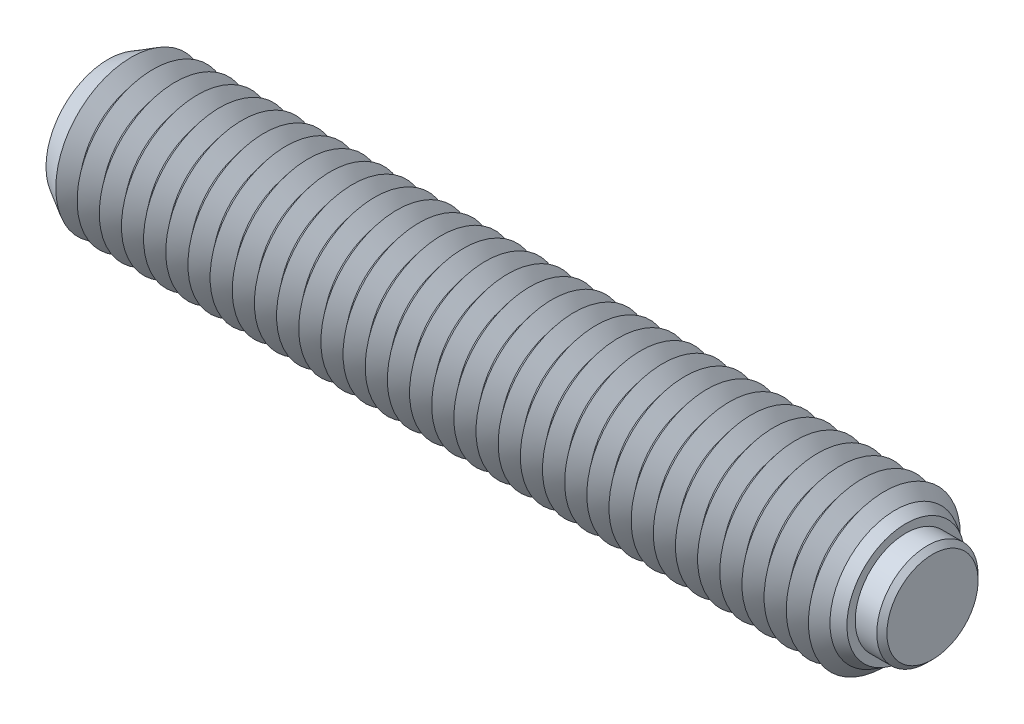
ISO-10303-21;
HEADER;
FILE_DESCRIPTION(('STEP AP214'),'2;1');
FILE_NAME('part.step','',(''),(''),'','','');
FILE_SCHEMA(('AUTOMOTIVE_DESIGN { 1 0 10303 214 1 1 1 1 }'));
ENDSEC;
DATA;
#1=APPLICATION_CONTEXT('core data for automotive mechanical design processes');
#2=APPLICATION_PROTOCOL_DEFINITION('international standard','automotive_design',2000,#1);
#3=PRODUCT_CONTEXT('',#1,'mechanical');
#4=PRODUCT('Part','Part','',(#3));
#5=PRODUCT_RELATED_PRODUCT_CATEGORY('part','',(#4));
#6=PRODUCT_DEFINITION_FORMATION('','',#4);
#7=PRODUCT_DEFINITION_CONTEXT('part definition',#1,'design');
#8=PRODUCT_DEFINITION('design','',#6,#7);
#9=PRODUCT_DEFINITION_SHAPE('','',#8);
#10=(LENGTH_UNIT() NAMED_UNIT(*) SI_UNIT(.MILLI.,.METRE.));
#11=(NAMED_UNIT(*) PLANE_ANGLE_UNIT() SI_UNIT($,.RADIAN.));
#12=(NAMED_UNIT(*) SI_UNIT($,.STERADIAN.) SOLID_ANGLE_UNIT());
#13=UNCERTAINTY_MEASURE_WITH_UNIT(LENGTH_MEASURE(1.E-05),#10,'distance_accuracy_value','');
#14=(GEOMETRIC_REPRESENTATION_CONTEXT(3) GLOBAL_UNCERTAINTY_ASSIGNED_CONTEXT((#13)) GLOBAL_UNIT_ASSIGNED_CONTEXT((#10,
#11,#12)) REPRESENTATION_CONTEXT('',''));
#15=CARTESIAN_POINT('',(0.,0.,0.));
#16=DIRECTION('',(0.,0.,1.));
#17=DIRECTION('',(1.,0.,0.));
#18=AXIS2_PLACEMENT_3D('',#15,#16,#17);
#19=CARTESIAN_POINT('',(2.95,0.,0.));
#20=DIRECTION('',(-1.,0.,0.));
#21=DIRECTION('',(0.,0.,1.));
#22=AXIS2_PLACEMENT_3D('',#19,#20,#21);
#23=CYLINDRICAL_SURFACE('',#22,4.);
#24=CARTESIAN_POINT('',(2.55,0.,0.));
#25=DIRECTION('',(1.,0.,0.));
#26=DIRECTION('',(0.,0.,-1.));
#27=AXIS2_PLACEMENT_3D('',#24,#25,#26);
#28=CIRCLE('',#27,4.);
#29=CARTESIAN_POINT('',(2.55,0.,4.));
#30=VERTEX_POINT('',#29);
#31=EDGE_CURVE('P0_E10',#30,#30,#28,.F.);
#32=ORIENTED_EDGE('',*,*,#31,.T.);
#33=EDGE_LOOP('',(#32));
#34=FACE_BOUND('',#33,.T.);
#35=CARTESIAN_POINT('',(-1.25,0.,0.));
#36=DIRECTION('',(1.,0.,0.));
#37=DIRECTION('',(0.,0.,-1.));
#38=AXIS2_PLACEMENT_3D('',#35,#36,#37);
#39=CIRCLE('',#38,4.);
#40=CARTESIAN_POINT('',(-1.25,0.,-4.));
#41=VERTEX_POINT('',#40);
#42=EDGE_CURVE('P0_E25',#41,#41,#39,.T.);
#43=ORIENTED_EDGE('',*,*,#42,.T.);
#44=EDGE_LOOP('',(#43));
#45=FACE_BOUND('',#44,.T.);
#46=ADVANCED_FACE('P0_F14',(#34,#45),#23,.T.);
#47=CARTESIAN_POINT('',(2.95,0.,0.));
#48=DIRECTION('',(1.,0.,0.));
#49=DIRECTION('',(0.,0.,-1.));
#50=AXIS2_PLACEMENT_3D('',#47,#48,#49);
#51=PLANE('',#50);
#52=CARTESIAN_POINT('',(2.95,0.,0.));
#53=DIRECTION('',(1.,0.,0.));
#54=DIRECTION('',(0.,0.,-1.));
#55=AXIS2_PLACEMENT_3D('',#52,#53,#54);
#56=CIRCLE('',#55,3.6);
#57=CARTESIAN_POINT('',(2.95,0.,3.6));
#58=VERTEX_POINT('',#57);
#59=EDGE_CURVE('P0_E21',#58,#58,#56,.T.);
#60=ORIENTED_EDGE('',*,*,#59,.T.);
#61=EDGE_LOOP('',(#60));
#62=FACE_BOUND('',#61,.T.);
#63=ADVANCED_FACE('P0_F35',(#62),#51,.T.);
#64=CARTESIAN_POINT('',(-1.25,0.,0.));
#65=DIRECTION('',(1.,0.,0.));
#66=DIRECTION('',(0.,0.,-1.));
#67=AXIS2_PLACEMENT_3D('',#64,#65,#66);
#68=PLANE('',#67);
#69=ORIENTED_EDGE('',*,*,#42,.F.);
#70=EDGE_LOOP('',(#69));
#71=FACE_BOUND('',#70,.T.);
#72=ADVANCED_FACE('P0_F33',(#71),#68,.F.);
#73=CARTESIAN_POINT('',(2.95,0.,0.));
#74=DIRECTION('',(-1.,0.,0.));
#75=DIRECTION('',(0.,0.,1.));
#76=AXIS2_PLACEMENT_3D('',#73,#74,#75);
#77=CONICAL_SURFACE('',#76,3.6,0.785398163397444);
#78=CARTESIAN_POINT('',(2.55,0.,4.));
#79=CARTESIAN_POINT('',(2.55416666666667,0.,3.99583333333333));
#80=CARTESIAN_POINT('',(2.55833333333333,0.,3.99166666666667));
#81=CARTESIAN_POINT('',(2.56666666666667,0.,3.98333333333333));
#82=CARTESIAN_POINT('',(2.57083333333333,0.,3.97916666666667));
#83=CARTESIAN_POINT('',(2.57916666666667,0.,3.97083333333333));
#84=CARTESIAN_POINT('',(2.58333333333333,0.,3.96666666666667));
#85=CARTESIAN_POINT('',(2.59166666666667,0.,3.95833333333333));
#86=CARTESIAN_POINT('',(2.59583333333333,0.,3.95416666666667));
#87=CARTESIAN_POINT('',(2.60416666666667,0.,3.94583333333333));
#88=CARTESIAN_POINT('',(2.60833333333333,0.,3.94166666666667));
#89=CARTESIAN_POINT('',(2.61666666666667,0.,3.93333333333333));
#90=CARTESIAN_POINT('',(2.62083333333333,0.,3.92916666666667));
#91=CARTESIAN_POINT('',(2.62916666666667,0.,3.92083333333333));
#92=CARTESIAN_POINT('',(2.63333333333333,0.,3.91666666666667));
#93=CARTESIAN_POINT('',(2.64166666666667,0.,3.90833333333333));
#94=CARTESIAN_POINT('',(2.64583333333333,0.,3.90416666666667));
#95=CARTESIAN_POINT('',(2.65416666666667,0.,3.89583333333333));
#96=CARTESIAN_POINT('',(2.65833333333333,0.,3.89166666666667));
#97=CARTESIAN_POINT('',(2.66666666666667,0.,3.88333333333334));
#98=CARTESIAN_POINT('',(2.67083333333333,0.,3.87916666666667));
#99=CARTESIAN_POINT('',(2.67916666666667,0.,3.87083333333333));
#100=CARTESIAN_POINT('',(2.68333333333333,0.,3.86666666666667));
#101=CARTESIAN_POINT('',(2.69166666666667,0.,3.85833333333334));
#102=CARTESIAN_POINT('',(2.69583333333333,0.,3.85416666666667));
#103=CARTESIAN_POINT('',(2.70416666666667,0.,3.84583333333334));
#104=CARTESIAN_POINT('',(2.70833333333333,0.,3.84166666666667));
#105=CARTESIAN_POINT('',(2.71666666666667,0.,3.83333333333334));
#106=CARTESIAN_POINT('',(2.72083333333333,0.,3.82916666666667));
#107=CARTESIAN_POINT('',(2.72916666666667,0.,3.82083333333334));
#108=CARTESIAN_POINT('',(2.73333333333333,0.,3.81666666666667));
#109=CARTESIAN_POINT('',(2.74166666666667,0.,3.80833333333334));
#110=CARTESIAN_POINT('',(2.74583333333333,0.,3.80416666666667));
#111=CARTESIAN_POINT('',(2.75416666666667,0.,3.79583333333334));
#112=CARTESIAN_POINT('',(2.75833333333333,0.,3.79166666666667));
#113=CARTESIAN_POINT('',(2.76666666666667,0.,3.78333333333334));
#114=CARTESIAN_POINT('',(2.77083333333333,0.,3.77916666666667));
#115=CARTESIAN_POINT('',(2.77916666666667,0.,3.77083333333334));
#116=CARTESIAN_POINT('',(2.78333333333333,0.,3.76666666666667));
#117=CARTESIAN_POINT('',(2.79166666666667,0.,3.75833333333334));
#118=CARTESIAN_POINT('',(2.79583333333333,0.,3.75416666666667));
#119=CARTESIAN_POINT('',(2.80416666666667,0.,3.74583333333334));
#120=CARTESIAN_POINT('',(2.80833333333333,0.,3.74166666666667));
#121=CARTESIAN_POINT('',(2.81666666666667,0.,3.73333333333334));
#122=CARTESIAN_POINT('',(2.82083333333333,0.,3.72916666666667));
#123=CARTESIAN_POINT('',(2.82916666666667,0.,3.72083333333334));
#124=CARTESIAN_POINT('',(2.83333333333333,0.,3.71666666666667));
#125=CARTESIAN_POINT('',(2.84166666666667,0.,3.70833333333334));
#126=CARTESIAN_POINT('',(2.84583333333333,0.,3.70416666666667));
#127=CARTESIAN_POINT('',(2.85416666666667,0.,3.69583333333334));
#128=CARTESIAN_POINT('',(2.85833333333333,0.,3.69166666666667));
#129=CARTESIAN_POINT('',(2.86666666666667,0.,3.68333333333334));
#130=CARTESIAN_POINT('',(2.87083333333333,0.,3.67916666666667));
#131=CARTESIAN_POINT('',(2.87916666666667,0.,3.67083333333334));
#132=CARTESIAN_POINT('',(2.88333333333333,0.,3.66666666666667));
#133=CARTESIAN_POINT('',(2.89166666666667,0.,3.65833333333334));
#134=CARTESIAN_POINT('',(2.89583333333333,0.,3.65416666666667));
#135=CARTESIAN_POINT('',(2.90416666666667,0.,3.64583333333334));
#136=CARTESIAN_POINT('',(2.90833333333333,0.,3.64166666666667));
#137=CARTESIAN_POINT('',(2.91666666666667,0.,3.63333333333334));
#138=CARTESIAN_POINT('',(2.92083333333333,0.,3.62916666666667));
#139=CARTESIAN_POINT('',(2.92916666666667,0.,3.62083333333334));
#140=CARTESIAN_POINT('',(2.93333333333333,0.,3.61666666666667));
#141=CARTESIAN_POINT('',(2.94166666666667,0.,3.60833333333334));
#142=CARTESIAN_POINT('',(2.94583333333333,0.,3.60416666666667));
#143=CARTESIAN_POINT('',(2.95,0.,3.6));
#144=B_SPLINE_CURVE_WITH_KNOTS('',3,(#78,#79,#80,#81,#82,#83,#84,#85,#86,#87,#88,#89,#90,#91,
#92,#93,#94,#95,#96,#97,#98,#99,#100,#101,#102,#103,#104,#105,#106,#107,#108,#109,#110,#111,
#112,#113,#114,#115,#116,#117,#118,#119,#120,#121,#122,#123,#124,#125,#126,#127,#128,#129,#130,
#131,#132,#133,#134,#135,#136,#137,#138,#139,#140,#141,#142,#143),.UNSPECIFIED.,.F.,.F.,(4,2,2,
2,2,2,2,2,2,2,2,2,2,2,2,2,2,2,2,2,2,2,2,2,2,2,2,2,2,2,2,2,4),(0.,0.0176776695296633,
0.0353553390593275,0.0530330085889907,0.070710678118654,0.0883883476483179,0.106066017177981,
0.123743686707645,0.141421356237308,0.159099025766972,0.176776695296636,0.194454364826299,
0.212132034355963,0.229809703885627,0.24748737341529,0.265165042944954,0.282842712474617,
0.300520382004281,0.318198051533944,0.335875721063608,0.353553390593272,0.371231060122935,
0.388908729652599,0.406586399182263,0.424264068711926,0.44194173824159,0.459619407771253,
0.477297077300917,0.49497474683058,0.512652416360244,0.530330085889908,0.548007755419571,
0.565685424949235),.UNSPECIFIED.);
#145=EDGE_CURVE('P0_BSEAM16',#30,#58,#144,.T.);
#146=ORIENTED_EDGE('',*,*,#31,.F.);
#147=ORIENTED_EDGE('',*,*,#59,.F.);
#148=ORIENTED_EDGE('',*,*,#145,.T.);
#149=ORIENTED_EDGE('',*,*,#145,.F.);
#150=EDGE_LOOP('',(#146,#148,#147,#149));
#151=FACE_BOUND('',#150,.T.);
#152=ADVANCED_FACE('P0_F16',(#151),#77,.T.);
#153=CLOSED_SHELL('',(#46,#63,#72,#152));
#154=MANIFOLD_SOLID_BREP('P0_B1',#153);
#155=CARTESIAN_POINT('',(-60.35,0.,0.));
#156=DIRECTION('',(-1.,0.,0.));
#157=DIRECTION('',(0.,0.,1.));
#158=AXIS2_PLACEMENT_3D('',#155,#156,#157);
#159=CONICAL_SURFACE('',#158,6.,0.895664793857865);
#160=CARTESIAN_POINT('',(-59.475,0.,0.));
#161=DIRECTION('',(1.,0.,0.));
#162=DIRECTION('',(0.,0.,-1.));
#163=AXIS2_PLACEMENT_3D('',#160,#161,#162);
#164=CIRCLE('',#163,4.90712535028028);
#165=CARTESIAN_POINT('',(-59.475,0.,-4.90712535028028));
#166=VERTEX_POINT('',#165);
#167=EDGE_CURVE('P1_E1373',#166,#166,#164,.T.);
#168=ORIENTED_EDGE('',*,*,#167,.F.);
#169=EDGE_LOOP('',(#168));
#170=FACE_BOUND('',#169,.T.);
#171=CARTESIAN_POINT('',(-60.3206276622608,0.,0.));
#172=DIRECTION('',(1.,0.,0.));
#173=DIRECTION('',(0.,0.,-1.));
#174=AXIS2_PLACEMENT_3D('',#171,#172,#173);
#175=CIRCLE('',#174,5.96331396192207);
#176=CARTESIAN_POINT('',(-60.3206276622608,0.,-5.96331396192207));
#177=VERTEX_POINT('',#176);
#178=EDGE_CURVE('P1_E1376',#177,#177,#175,.F.);
#179=ORIENTED_EDGE('',*,*,#178,.F.);
#180=EDGE_LOOP('',(#179));
#181=FACE_BOUND('',#180,.T.);
#182=ADVANCED_FACE('P1_F15',(#170,#181),#159,.T.);
#183=CARTESIAN_POINT('',(-1.725,0.,0.));
#184=DIRECTION('',(1.,0.,0.));
#185=DIRECTION('',(0.,0.,-1.));
#186=AXIS2_PLACEMENT_3D('',#183,#184,#185);
#187=CONICAL_SURFACE('',#186,4.90712535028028,0.895664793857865);
#188=CARTESIAN_POINT('',(-0.849999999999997,0.,0.));
#189=DIRECTION('',(1.,0.,0.));
#190=DIRECTION('',(0.,0.,-1.));
#191=AXIS2_PLACEMENT_3D('',#188,#189,#190);
#192=CIRCLE('',#191,6.);
#193=CARTESIAN_POINT('',(-0.849999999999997,0.,-6.));
#194=VERTEX_POINT('',#193);
#195=EDGE_CURVE('P1_E1171',#194,#194,#192,.T.);
#196=ORIENTED_EDGE('',*,*,#195,.F.);
#197=EDGE_LOOP('',(#196));
#198=FACE_BOUND('',#197,.T.);
#199=CARTESIAN_POINT('',(-1.725,0.,0.));
#200=DIRECTION('',(1.,0.,0.));
#201=DIRECTION('',(0.,0.,-1.));
#202=AXIS2_PLACEMENT_3D('',#199,#200,#201);
#203=CIRCLE('',#202,4.90712535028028);
#204=CARTESIAN_POINT('',(-1.725,0.,-4.90712535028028));
#205=VERTEX_POINT('',#204);
#206=EDGE_CURVE('P1_E1172',#205,#205,#203,.T.);
#207=ORIENTED_EDGE('',*,*,#206,.T.);
#208=EDGE_LOOP('',(#207));
#209=FACE_BOUND('',#208,.T.);
#210=ADVANCED_FACE('P1_F222',(#198,#209),#187,.T.);
#211=CARTESIAN_POINT('',(-2.6,0.,0.));
#212=DIRECTION('',(-1.,0.,0.));
#213=DIRECTION('',(0.,0.,1.));
#214=AXIS2_PLACEMENT_3D('',#211,#212,#213);
#215=CONICAL_SURFACE('',#214,6.,0.895664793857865);
#216=ORIENTED_EDGE('',*,*,#206,.F.);
#217=EDGE_LOOP('',(#216));
#218=FACE_BOUND('',#217,.T.);
#219=CARTESIAN_POINT('',(-2.6,0.,0.));
#220=DIRECTION('',(1.,0.,0.));
#221=DIRECTION('',(0.,0.,-1.));
#222=AXIS2_PLACEMENT_3D('',#219,#220,#221);
#223=CIRCLE('',#222,6.);
#224=CARTESIAN_POINT('',(-2.6,0.,-6.));
#225=VERTEX_POINT('',#224);
#226=EDGE_CURVE('P1_E1176',#225,#225,#223,.T.);
#227=ORIENTED_EDGE('',*,*,#226,.T.);
#228=EDGE_LOOP('',(#227));
#229=FACE_BOUND('',#228,.T.);
#230=ADVANCED_FACE('P1_F227',(#218,#229),#215,.T.);
#231=CARTESIAN_POINT('',(-1.25,0.,0.));
#232=DIRECTION('',(1.,0.,0.));
#233=DIRECTION('',(0.,1.,0.));
#234=AXIS2_PLACEMENT_3D('',#231,#232,#233);
#235=PLANE('',#234);
#236=CARTESIAN_POINT('',(-1.25,0.,0.));
#237=DIRECTION('',(1.,0.,0.));
#238=DIRECTION('',(0.,1.,0.));
#239=AXIS2_PLACEMENT_3D('',#236,#237,#238);
#240=CIRCLE('',#239,4.);
#241=CARTESIAN_POINT('',(-1.25,4.,0.));
#242=VERTEX_POINT('',#241);
#243=EDGE_CURVE('P1_E566',#242,#242,#240,.T.);
#244=ORIENTED_EDGE('',*,*,#243,.T.);
#245=EDGE_LOOP('',(#244));
#246=FACE_BOUND('',#245,.T.);
#247=ADVANCED_FACE('P1_F493',(#246),#235,.T.);
#248=CARTESIAN_POINT('',(-1.25,0.,0.));
#249=DIRECTION('',(1.,0.,0.));
#250=DIRECTION('',(0.,1.,0.));
#251=AXIS2_PLACEMENT_3D('',#248,#249,#250);
#252=CYLINDRICAL_SURFACE('',#251,4.);
#253=ORIENTED_EDGE('',*,*,#243,.F.);
#254=EDGE_LOOP('',(#253));
#255=FACE_BOUND('',#254,.T.);
#256=CARTESIAN_POINT('',(0.85,0.,0.));
#257=DIRECTION('',(1.,0.,0.));
#258=DIRECTION('',(0.,1.,0.));
#259=AXIS2_PLACEMENT_3D('',#256,#257,#258);
#260=CIRCLE('',#259,4.);
#261=CARTESIAN_POINT('',(0.85,4.,0.));
#262=VERTEX_POINT('',#261);
#263=EDGE_CURVE('P1_E569',#262,#262,#260,.T.);
#264=ORIENTED_EDGE('',*,*,#263,.T.);
#265=EDGE_LOOP('',(#264));
#266=FACE_BOUND('',#265,.T.);
#267=ADVANCED_FACE('P1_F209',(#255,#266),#252,.F.);
#268=CARTESIAN_POINT('',(0.849999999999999,4.65925227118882,0.));
#269=DIRECTION('',(1.,0.,0.));
#270=DIRECTION('',(0.,1.,0.));
#271=AXIS2_PLACEMENT_3D('',#268,#269,#270);
#272=PLANE('',#271);
#273=ORIENTED_EDGE('',*,*,#263,.F.);
#274=EDGE_LOOP('',(#273));
#275=FACE_BOUND('',#274,.T.);
#276=CARTESIAN_POINT('',(0.85,0.,0.));
#277=DIRECTION('',(1.,0.,0.));
#278=DIRECTION('',(0.,1.,0.));
#279=AXIS2_PLACEMENT_3D('',#276,#277,#278);
#280=CIRCLE('',#279,4.65925227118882);
#281=CARTESIAN_POINT('',(0.849999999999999,4.65925227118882,0.));
#282=VERTEX_POINT('',#281);
#283=EDGE_CURVE('P1_E121',#282,#282,#280,.T.);
#284=ORIENTED_EDGE('',*,*,#283,.T.);
#285=EDGE_LOOP('',(#284));
#286=FACE_BOUND('',#285,.T.);
#287=ADVANCED_FACE('P1_F206',(#275,#286),#272,.T.);
#288=CARTESIAN_POINT('',(0.85,0.,0.));
#289=DIRECTION('',(-1.,0.,0.));
#290=DIRECTION('',(0.,-1.,0.));
#291=AXIS2_PLACEMENT_3D('',#288,#289,#290);
#292=CONICAL_SURFACE('',#291,4.65925227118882,0.523598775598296);
#293=CARTESIAN_POINT('',(0.,0.,0.));
#294=DIRECTION('',(1.,0.,0.));
#295=DIRECTION('',(0.,0.,-1.));
#296=AXIS2_PLACEMENT_3D('',#293,#294,#295);
#297=CIRCLE('',#296,5.15);
#298=CARTESIAN_POINT('',(0.,0.,-5.15));
#299=VERTEX_POINT('',#298);
#300=EDGE_CURVE('P1_E557',#299,#299,#297,.T.);
#301=ORIENTED_EDGE('',*,*,#300,.T.);
#302=EDGE_LOOP('',(#301));
#303=FACE_BOUND('',#302,.T.);
#304=ORIENTED_EDGE('',*,*,#283,.F.);
#305=EDGE_LOOP('',(#304));
#306=FACE_BOUND('',#305,.T.);
#307=ADVANCED_FACE('P1_F203',(#303,#306),#292,.T.);
#308=CARTESIAN_POINT('',(0.,0.,0.));
#309=DIRECTION('',(-1.,0.,0.));
#310=DIRECTION('',(0.,0.,1.));
#311=AXIS2_PLACEMENT_3D('',#308,#309,#310);
#312=CONICAL_SURFACE('',#311,5.15,0.78539816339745);
#313=ORIENTED_EDGE('',*,*,#195,.T.);
#314=EDGE_LOOP('',(#313));
#315=FACE_BOUND('',#314,.T.);
#316=ORIENTED_EDGE('',*,*,#300,.F.);
#317=EDGE_LOOP('',(#316));
#318=FACE_BOUND('',#317,.T.);
#319=ADVANCED_FACE('P1_F17',(#315,#318),#312,.T.);
#320=CARTESIAN_POINT('',(-3.475,0.,0.));
#321=DIRECTION('',(1.,0.,0.));
#322=DIRECTION('',(0.,0.,-1.));
#323=AXIS2_PLACEMENT_3D('',#320,#321,#322);
#324=CONICAL_SURFACE('',#323,4.90712535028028,0.895664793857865);
#325=ORIENTED_EDGE('',*,*,#226,.F.);
#326=EDGE_LOOP('',(#325));
#327=FACE_BOUND('',#326,.T.);
#328=CARTESIAN_POINT('',(-3.475,0.,0.));
#329=DIRECTION('',(1.,0.,0.));
#330=DIRECTION('',(0.,0.,-1.));
#331=AXIS2_PLACEMENT_3D('',#328,#329,#330);
#332=CIRCLE('',#331,4.90712535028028);
#333=CARTESIAN_POINT('',(-3.475,0.,-4.90712535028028));
#334=VERTEX_POINT('',#333);
#335=EDGE_CURVE('P1_E1181',#334,#334,#332,.T.);
#336=ORIENTED_EDGE('',*,*,#335,.T.);
#337=EDGE_LOOP('',(#336));
#338=FACE_BOUND('',#337,.T.);
#339=ADVANCED_FACE('P1_F487',(#327,#338),#324,.T.);
#340=CARTESIAN_POINT('',(-4.35,0.,0.));
#341=DIRECTION('',(-1.,0.,0.));
#342=DIRECTION('',(0.,0.,1.));
#343=AXIS2_PLACEMENT_3D('',#340,#341,#342);
#344=CONICAL_SURFACE('',#343,6.,0.895664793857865);
#345=ORIENTED_EDGE('',*,*,#335,.F.);
#346=EDGE_LOOP('',(#345));
#347=FACE_BOUND('',#346,.T.);
#348=CARTESIAN_POINT('',(-4.35,0.,0.));
#349=DIRECTION('',(1.,0.,0.));
#350=DIRECTION('',(0.,0.,-1.));
#351=AXIS2_PLACEMENT_3D('',#348,#349,#350);
#352=CIRCLE('',#351,6.);
#353=CARTESIAN_POINT('',(-4.35,0.,-6.));
#354=VERTEX_POINT('',#353);
#355=EDGE_CURVE('P1_E1184',#354,#354,#352,.T.);
#356=ORIENTED_EDGE('',*,*,#355,.T.);
#357=EDGE_LOOP('',(#356));
#358=FACE_BOUND('',#357,.T.);
#359=ADVANCED_FACE('P1_F483',(#347,#358),#344,.T.);
#360=CARTESIAN_POINT('',(-5.225,0.,0.));
#361=DIRECTION('',(1.,0.,0.));
#362=DIRECTION('',(0.,0.,-1.));
#363=AXIS2_PLACEMENT_3D('',#360,#361,#362);
#364=CONICAL_SURFACE('',#363,4.90712535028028,0.895664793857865);
#365=ORIENTED_EDGE('',*,*,#355,.F.);
#366=EDGE_LOOP('',(#365));
#367=FACE_BOUND('',#366,.T.);
#368=CARTESIAN_POINT('',(-5.225,0.,0.));
#369=DIRECTION('',(1.,0.,0.));
#370=DIRECTION('',(0.,0.,-1.));
#371=AXIS2_PLACEMENT_3D('',#368,#369,#370);
#372=CIRCLE('',#371,4.90712535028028);
#373=CARTESIAN_POINT('',(-5.225,0.,-4.90712535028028));
#374=VERTEX_POINT('',#373);
#375=EDGE_CURVE('P1_E1187',#374,#374,#372,.T.);
#376=ORIENTED_EDGE('',*,*,#375,.T.);
#377=EDGE_LOOP('',(#376));
#378=FACE_BOUND('',#377,.T.);
#379=ADVANCED_FACE('P1_F479',(#367,#378),#364,.T.);
#380=CARTESIAN_POINT('',(-6.1,0.,0.));
#381=DIRECTION('',(-1.,0.,0.));
#382=DIRECTION('',(0.,0.,1.));
#383=AXIS2_PLACEMENT_3D('',#380,#381,#382);
#384=CONICAL_SURFACE('',#383,6.,0.895664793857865);
#385=ORIENTED_EDGE('',*,*,#375,.F.);
#386=EDGE_LOOP('',(#385));
#387=FACE_BOUND('',#386,.T.);
#388=CARTESIAN_POINT('',(-6.1,0.,0.));
#389=DIRECTION('',(1.,0.,0.));
#390=DIRECTION('',(0.,0.,-1.));
#391=AXIS2_PLACEMENT_3D('',#388,#389,#390);
#392=CIRCLE('',#391,6.);
#393=CARTESIAN_POINT('',(-6.1,0.,-6.));
#394=VERTEX_POINT('',#393);
#395=EDGE_CURVE('P1_E1190',#394,#394,#392,.T.);
#396=ORIENTED_EDGE('',*,*,#395,.T.);
#397=EDGE_LOOP('',(#396));
#398=FACE_BOUND('',#397,.T.);
#399=ADVANCED_FACE('P1_F475',(#387,#398),#384,.T.);
#400=CARTESIAN_POINT('',(-6.975,0.,0.));
#401=DIRECTION('',(1.,0.,0.));
#402=DIRECTION('',(0.,0.,-1.));
#403=AXIS2_PLACEMENT_3D('',#400,#401,#402);
#404=CONICAL_SURFACE('',#403,4.90712535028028,0.895664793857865);
#405=ORIENTED_EDGE('',*,*,#395,.F.);
#406=EDGE_LOOP('',(#405));
#407=FACE_BOUND('',#406,.T.);
#408=CARTESIAN_POINT('',(-6.975,0.,0.));
#409=DIRECTION('',(1.,0.,0.));
#410=DIRECTION('',(0.,0.,-1.));
#411=AXIS2_PLACEMENT_3D('',#408,#409,#410);
#412=CIRCLE('',#411,4.90712535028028);
#413=CARTESIAN_POINT('',(-6.975,0.,-4.90712535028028));
#414=VERTEX_POINT('',#413);
#415=EDGE_CURVE('P1_E1193',#414,#414,#412,.T.);
#416=ORIENTED_EDGE('',*,*,#415,.T.);
#417=EDGE_LOOP('',(#416));
#418=FACE_BOUND('',#417,.T.);
#419=ADVANCED_FACE('P1_F471',(#407,#418),#404,.T.);
#420=CARTESIAN_POINT('',(-7.85,0.,0.));
#421=DIRECTION('',(-1.,0.,0.));
#422=DIRECTION('',(0.,0.,1.));
#423=AXIS2_PLACEMENT_3D('',#420,#421,#422);
#424=CONICAL_SURFACE('',#423,6.,0.895664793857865);
#425=ORIENTED_EDGE('',*,*,#415,.F.);
#426=EDGE_LOOP('',(#425));
#427=FACE_BOUND('',#426,.T.);
#428=CARTESIAN_POINT('',(-7.85,0.,0.));
#429=DIRECTION('',(1.,0.,0.));
#430=DIRECTION('',(0.,0.,-1.));
#431=AXIS2_PLACEMENT_3D('',#428,#429,#430);
#432=CIRCLE('',#431,6.);
#433=CARTESIAN_POINT('',(-7.85,0.,-6.));
#434=VERTEX_POINT('',#433);
#435=EDGE_CURVE('P1_E1196',#434,#434,#432,.T.);
#436=ORIENTED_EDGE('',*,*,#435,.T.);
#437=EDGE_LOOP('',(#436));
#438=FACE_BOUND('',#437,.T.);
#439=ADVANCED_FACE('P1_F467',(#427,#438),#424,.T.);
#440=CARTESIAN_POINT('',(-8.725,0.,0.));
#441=DIRECTION('',(1.,0.,0.));
#442=DIRECTION('',(0.,0.,-1.));
#443=AXIS2_PLACEMENT_3D('',#440,#441,#442);
#444=CONICAL_SURFACE('',#443,4.90712535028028,0.895664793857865);
#445=ORIENTED_EDGE('',*,*,#435,.F.);
#446=EDGE_LOOP('',(#445));
#447=FACE_BOUND('',#446,.T.);
#448=CARTESIAN_POINT('',(-8.725,0.,0.));
#449=DIRECTION('',(1.,0.,0.));
#450=DIRECTION('',(0.,0.,-1.));
#451=AXIS2_PLACEMENT_3D('',#448,#449,#450);
#452=CIRCLE('',#451,4.90712535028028);
#453=CARTESIAN_POINT('',(-8.725,0.,-4.90712535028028));
#454=VERTEX_POINT('',#453);
#455=EDGE_CURVE('P1_E1199',#454,#454,#452,.T.);
#456=ORIENTED_EDGE('',*,*,#455,.T.);
#457=EDGE_LOOP('',(#456));
#458=FACE_BOUND('',#457,.T.);
#459=ADVANCED_FACE('P1_F463',(#447,#458),#444,.T.);
#460=CARTESIAN_POINT('',(-9.6,0.,0.));
#461=DIRECTION('',(-1.,0.,0.));
#462=DIRECTION('',(0.,0.,1.));
#463=AXIS2_PLACEMENT_3D('',#460,#461,#462);
#464=CONICAL_SURFACE('',#463,6.,0.895664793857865);
#465=ORIENTED_EDGE('',*,*,#455,.F.);
#466=EDGE_LOOP('',(#465));
#467=FACE_BOUND('',#466,.T.);
#468=CARTESIAN_POINT('',(-9.6,0.,0.));
#469=DIRECTION('',(1.,0.,0.));
#470=DIRECTION('',(0.,0.,-1.));
#471=AXIS2_PLACEMENT_3D('',#468,#469,#470);
#472=CIRCLE('',#471,6.);
#473=CARTESIAN_POINT('',(-9.6,0.,-6.));
#474=VERTEX_POINT('',#473);
#475=EDGE_CURVE('P1_E1202',#474,#474,#472,.T.);
#476=ORIENTED_EDGE('',*,*,#475,.T.);
#477=EDGE_LOOP('',(#476));
#478=FACE_BOUND('',#477,.T.);
#479=ADVANCED_FACE('P1_F459',(#467,#478),#464,.T.);
#480=CARTESIAN_POINT('',(-10.475,0.,0.));
#481=DIRECTION('',(1.,0.,0.));
#482=DIRECTION('',(0.,0.,-1.));
#483=AXIS2_PLACEMENT_3D('',#480,#481,#482);
#484=CONICAL_SURFACE('',#483,4.90712535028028,0.895664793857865);
#485=ORIENTED_EDGE('',*,*,#475,.F.);
#486=EDGE_LOOP('',(#485));
#487=FACE_BOUND('',#486,.T.);
#488=CARTESIAN_POINT('',(-10.475,0.,0.));
#489=DIRECTION('',(1.,0.,0.));
#490=DIRECTION('',(0.,0.,-1.));
#491=AXIS2_PLACEMENT_3D('',#488,#489,#490);
#492=CIRCLE('',#491,4.90712535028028);
#493=CARTESIAN_POINT('',(-10.475,0.,-4.90712535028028));
#494=VERTEX_POINT('',#493);
#495=EDGE_CURVE('P1_E1205',#494,#494,#492,.T.);
#496=ORIENTED_EDGE('',*,*,#495,.T.);
#497=EDGE_LOOP('',(#496));
#498=FACE_BOUND('',#497,.T.);
#499=ADVANCED_FACE('P1_F455',(#487,#498),#484,.T.);
#500=CARTESIAN_POINT('',(-11.35,0.,0.));
#501=DIRECTION('',(-1.,0.,0.));
#502=DIRECTION('',(0.,0.,1.));
#503=AXIS2_PLACEMENT_3D('',#500,#501,#502);
#504=CONICAL_SURFACE('',#503,6.,0.895664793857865);
#505=ORIENTED_EDGE('',*,*,#495,.F.);
#506=EDGE_LOOP('',(#505));
#507=FACE_BOUND('',#506,.T.);
#508=CARTESIAN_POINT('',(-11.35,0.,0.));
#509=DIRECTION('',(1.,0.,0.));
#510=DIRECTION('',(0.,0.,-1.));
#511=AXIS2_PLACEMENT_3D('',#508,#509,#510);
#512=CIRCLE('',#511,6.);
#513=CARTESIAN_POINT('',(-11.35,0.,-6.));
#514=VERTEX_POINT('',#513);
#515=EDGE_CURVE('P1_E1208',#514,#514,#512,.T.);
#516=ORIENTED_EDGE('',*,*,#515,.T.);
#517=EDGE_LOOP('',(#516));
#518=FACE_BOUND('',#517,.T.);
#519=ADVANCED_FACE('P1_F451',(#507,#518),#504,.T.);
#520=CARTESIAN_POINT('',(-12.225,0.,0.));
#521=DIRECTION('',(1.,0.,0.));
#522=DIRECTION('',(0.,0.,-1.));
#523=AXIS2_PLACEMENT_3D('',#520,#521,#522);
#524=CONICAL_SURFACE('',#523,4.90712535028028,0.895664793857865);
#525=ORIENTED_EDGE('',*,*,#515,.F.);
#526=EDGE_LOOP('',(#525));
#527=FACE_BOUND('',#526,.T.);
#528=CARTESIAN_POINT('',(-12.225,0.,0.));
#529=DIRECTION('',(1.,0.,0.));
#530=DIRECTION('',(0.,0.,-1.));
#531=AXIS2_PLACEMENT_3D('',#528,#529,#530);
#532=CIRCLE('',#531,4.90712535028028);
#533=CARTESIAN_POINT('',(-12.225,0.,-4.90712535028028));
#534=VERTEX_POINT('',#533);
#535=EDGE_CURVE('P1_E1211',#534,#534,#532,.T.);
#536=ORIENTED_EDGE('',*,*,#535,.T.);
#537=EDGE_LOOP('',(#536));
#538=FACE_BOUND('',#537,.T.);
#539=ADVANCED_FACE('P1_F447',(#527,#538),#524,.T.);
#540=CARTESIAN_POINT('',(-13.1,0.,0.));
#541=DIRECTION('',(-1.,0.,0.));
#542=DIRECTION('',(0.,0.,1.));
#543=AXIS2_PLACEMENT_3D('',#540,#541,#542);
#544=CONICAL_SURFACE('',#543,6.,0.895664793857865);
#545=ORIENTED_EDGE('',*,*,#535,.F.);
#546=EDGE_LOOP('',(#545));
#547=FACE_BOUND('',#546,.T.);
#548=CARTESIAN_POINT('',(-13.1,0.,0.));
#549=DIRECTION('',(1.,0.,0.));
#550=DIRECTION('',(0.,0.,-1.));
#551=AXIS2_PLACEMENT_3D('',#548,#549,#550);
#552=CIRCLE('',#551,6.);
#553=CARTESIAN_POINT('',(-13.1,0.,-6.));
#554=VERTEX_POINT('',#553);
#555=EDGE_CURVE('P1_E1214',#554,#554,#552,.T.);
#556=ORIENTED_EDGE('',*,*,#555,.T.);
#557=EDGE_LOOP('',(#556));
#558=FACE_BOUND('',#557,.T.);
#559=ADVANCED_FACE('P1_F443',(#547,#558),#544,.T.);
#560=CARTESIAN_POINT('',(-13.975,0.,0.));
#561=DIRECTION('',(1.,0.,0.));
#562=DIRECTION('',(0.,0.,-1.));
#563=AXIS2_PLACEMENT_3D('',#560,#561,#562);
#564=CONICAL_SURFACE('',#563,4.90712535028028,0.895664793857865);
#565=ORIENTED_EDGE('',*,*,#555,.F.);
#566=EDGE_LOOP('',(#565));
#567=FACE_BOUND('',#566,.T.);
#568=CARTESIAN_POINT('',(-13.975,0.,0.));
#569=DIRECTION('',(1.,0.,0.));
#570=DIRECTION('',(0.,0.,-1.));
#571=AXIS2_PLACEMENT_3D('',#568,#569,#570);
#572=CIRCLE('',#571,4.90712535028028);
#573=CARTESIAN_POINT('',(-13.975,0.,-4.90712535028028));
#574=VERTEX_POINT('',#573);
#575=EDGE_CURVE('P1_E1217',#574,#574,#572,.T.);
#576=ORIENTED_EDGE('',*,*,#575,.T.);
#577=EDGE_LOOP('',(#576));
#578=FACE_BOUND('',#577,.T.);
#579=ADVANCED_FACE('P1_F439',(#567,#578),#564,.T.);
#580=CARTESIAN_POINT('',(-14.85,0.,0.));
#581=DIRECTION('',(-1.,0.,0.));
#582=DIRECTION('',(0.,0.,1.));
#583=AXIS2_PLACEMENT_3D('',#580,#581,#582);
#584=CONICAL_SURFACE('',#583,6.,0.895664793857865);
#585=ORIENTED_EDGE('',*,*,#575,.F.);
#586=EDGE_LOOP('',(#585));
#587=FACE_BOUND('',#586,.T.);
#588=CARTESIAN_POINT('',(-14.85,0.,0.));
#589=DIRECTION('',(1.,0.,0.));
#590=DIRECTION('',(0.,0.,-1.));
#591=AXIS2_PLACEMENT_3D('',#588,#589,#590);
#592=CIRCLE('',#591,6.);
#593=CARTESIAN_POINT('',(-14.85,0.,-6.));
#594=VERTEX_POINT('',#593);
#595=EDGE_CURVE('P1_E1220',#594,#594,#592,.T.);
#596=ORIENTED_EDGE('',*,*,#595,.T.);
#597=EDGE_LOOP('',(#596));
#598=FACE_BOUND('',#597,.T.);
#599=ADVANCED_FACE('P1_F435',(#587,#598),#584,.T.);
#600=CARTESIAN_POINT('',(-15.725,0.,0.));
#601=DIRECTION('',(1.,0.,0.));
#602=DIRECTION('',(0.,0.,-1.));
#603=AXIS2_PLACEMENT_3D('',#600,#601,#602);
#604=CONICAL_SURFACE('',#603,4.90712535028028,0.895664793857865);
#605=ORIENTED_EDGE('',*,*,#595,.F.);
#606=EDGE_LOOP('',(#605));
#607=FACE_BOUND('',#606,.T.);
#608=CARTESIAN_POINT('',(-15.725,0.,0.));
#609=DIRECTION('',(1.,0.,0.));
#610=DIRECTION('',(0.,0.,-1.));
#611=AXIS2_PLACEMENT_3D('',#608,#609,#610);
#612=CIRCLE('',#611,4.90712535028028);
#613=CARTESIAN_POINT('',(-15.725,0.,-4.90712535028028));
#614=VERTEX_POINT('',#613);
#615=EDGE_CURVE('P1_E1223',#614,#614,#612,.T.);
#616=ORIENTED_EDGE('',*,*,#615,.T.);
#617=EDGE_LOOP('',(#616));
#618=FACE_BOUND('',#617,.T.);
#619=ADVANCED_FACE('P1_F431',(#607,#618),#604,.T.);
#620=CARTESIAN_POINT('',(-16.6,0.,0.));
#621=DIRECTION('',(-1.,0.,0.));
#622=DIRECTION('',(0.,0.,1.));
#623=AXIS2_PLACEMENT_3D('',#620,#621,#622);
#624=CONICAL_SURFACE('',#623,6.,0.895664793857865);
#625=ORIENTED_EDGE('',*,*,#615,.F.);
#626=EDGE_LOOP('',(#625));
#627=FACE_BOUND('',#626,.T.);
#628=CARTESIAN_POINT('',(-16.6,0.,0.));
#629=DIRECTION('',(1.,0.,0.));
#630=DIRECTION('',(0.,0.,-1.));
#631=AXIS2_PLACEMENT_3D('',#628,#629,#630);
#632=CIRCLE('',#631,6.);
#633=CARTESIAN_POINT('',(-16.6,0.,-6.));
#634=VERTEX_POINT('',#633);
#635=EDGE_CURVE('P1_E1226',#634,#634,#632,.T.);
#636=ORIENTED_EDGE('',*,*,#635,.T.);
#637=EDGE_LOOP('',(#636));
#638=FACE_BOUND('',#637,.T.);
#639=ADVANCED_FACE('P1_F427',(#627,#638),#624,.T.);
#640=CARTESIAN_POINT('',(-17.475,0.,0.));
#641=DIRECTION('',(1.,0.,0.));
#642=DIRECTION('',(0.,0.,-1.));
#643=AXIS2_PLACEMENT_3D('',#640,#641,#642);
#644=CONICAL_SURFACE('',#643,4.90712535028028,0.895664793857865);
#645=ORIENTED_EDGE('',*,*,#635,.F.);
#646=EDGE_LOOP('',(#645));
#647=FACE_BOUND('',#646,.T.);
#648=CARTESIAN_POINT('',(-17.475,0.,0.));
#649=DIRECTION('',(1.,0.,0.));
#650=DIRECTION('',(0.,0.,-1.));
#651=AXIS2_PLACEMENT_3D('',#648,#649,#650);
#652=CIRCLE('',#651,4.90712535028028);
#653=CARTESIAN_POINT('',(-17.475,0.,-4.90712535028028));
#654=VERTEX_POINT('',#653);
#655=EDGE_CURVE('P1_E1229',#654,#654,#652,.T.);
#656=ORIENTED_EDGE('',*,*,#655,.T.);
#657=EDGE_LOOP('',(#656));
#658=FACE_BOUND('',#657,.T.);
#659=ADVANCED_FACE('P1_F423',(#647,#658),#644,.T.);
#660=CARTESIAN_POINT('',(-18.35,0.,0.));
#661=DIRECTION('',(-1.,0.,0.));
#662=DIRECTION('',(0.,0.,1.));
#663=AXIS2_PLACEMENT_3D('',#660,#661,#662);
#664=CONICAL_SURFACE('',#663,6.,0.895664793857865);
#665=ORIENTED_EDGE('',*,*,#655,.F.);
#666=EDGE_LOOP('',(#665));
#667=FACE_BOUND('',#666,.T.);
#668=CARTESIAN_POINT('',(-18.35,0.,0.));
#669=DIRECTION('',(1.,0.,0.));
#670=DIRECTION('',(0.,0.,-1.));
#671=AXIS2_PLACEMENT_3D('',#668,#669,#670);
#672=CIRCLE('',#671,6.);
#673=CARTESIAN_POINT('',(-18.35,0.,-6.));
#674=VERTEX_POINT('',#673);
#675=EDGE_CURVE('P1_E1232',#674,#674,#672,.T.);
#676=ORIENTED_EDGE('',*,*,#675,.T.);
#677=EDGE_LOOP('',(#676));
#678=FACE_BOUND('',#677,.T.);
#679=ADVANCED_FACE('P1_F419',(#667,#678),#664,.T.);
#680=CARTESIAN_POINT('',(-19.225,0.,0.));
#681=DIRECTION('',(1.,0.,0.));
#682=DIRECTION('',(0.,0.,-1.));
#683=AXIS2_PLACEMENT_3D('',#680,#681,#682);
#684=CONICAL_SURFACE('',#683,4.90712535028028,0.895664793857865);
#685=ORIENTED_EDGE('',*,*,#675,.F.);
#686=EDGE_LOOP('',(#685));
#687=FACE_BOUND('',#686,.T.);
#688=CARTESIAN_POINT('',(-19.225,0.,0.));
#689=DIRECTION('',(1.,0.,0.));
#690=DIRECTION('',(0.,0.,-1.));
#691=AXIS2_PLACEMENT_3D('',#688,#689,#690);
#692=CIRCLE('',#691,4.90712535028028);
#693=CARTESIAN_POINT('',(-19.225,0.,-4.90712535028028));
#694=VERTEX_POINT('',#693);
#695=EDGE_CURVE('P1_E1235',#694,#694,#692,.T.);
#696=ORIENTED_EDGE('',*,*,#695,.T.);
#697=EDGE_LOOP('',(#696));
#698=FACE_BOUND('',#697,.T.);
#699=ADVANCED_FACE('P1_F415',(#687,#698),#684,.T.);
#700=CARTESIAN_POINT('',(-20.1,0.,0.));
#701=DIRECTION('',(-1.,0.,0.));
#702=DIRECTION('',(0.,0.,1.));
#703=AXIS2_PLACEMENT_3D('',#700,#701,#702);
#704=CONICAL_SURFACE('',#703,6.,0.895664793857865);
#705=ORIENTED_EDGE('',*,*,#695,.F.);
#706=EDGE_LOOP('',(#705));
#707=FACE_BOUND('',#706,.T.);
#708=CARTESIAN_POINT('',(-20.1,0.,0.));
#709=DIRECTION('',(1.,0.,0.));
#710=DIRECTION('',(0.,0.,-1.));
#711=AXIS2_PLACEMENT_3D('',#708,#709,#710);
#712=CIRCLE('',#711,6.);
#713=CARTESIAN_POINT('',(-20.1,0.,-6.));
#714=VERTEX_POINT('',#713);
#715=EDGE_CURVE('P1_E1238',#714,#714,#712,.T.);
#716=ORIENTED_EDGE('',*,*,#715,.T.);
#717=EDGE_LOOP('',(#716));
#718=FACE_BOUND('',#717,.T.);
#719=ADVANCED_FACE('P1_F411',(#707,#718),#704,.T.);
#720=CARTESIAN_POINT('',(-20.975,0.,0.));
#721=DIRECTION('',(1.,0.,0.));
#722=DIRECTION('',(0.,0.,-1.));
#723=AXIS2_PLACEMENT_3D('',#720,#721,#722);
#724=CONICAL_SURFACE('',#723,4.90712535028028,0.895664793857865);
#725=ORIENTED_EDGE('',*,*,#715,.F.);
#726=EDGE_LOOP('',(#725));
#727=FACE_BOUND('',#726,.T.);
#728=CARTESIAN_POINT('',(-20.975,0.,0.));
#729=DIRECTION('',(1.,0.,0.));
#730=DIRECTION('',(0.,0.,-1.));
#731=AXIS2_PLACEMENT_3D('',#728,#729,#730);
#732=CIRCLE('',#731,4.90712535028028);
#733=CARTESIAN_POINT('',(-20.975,0.,-4.90712535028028));
#734=VERTEX_POINT('',#733);
#735=EDGE_CURVE('P1_E1241',#734,#734,#732,.T.);
#736=ORIENTED_EDGE('',*,*,#735,.T.);
#737=EDGE_LOOP('',(#736));
#738=FACE_BOUND('',#737,.T.);
#739=ADVANCED_FACE('P1_F407',(#727,#738),#724,.T.);
#740=CARTESIAN_POINT('',(-21.85,0.,0.));
#741=DIRECTION('',(-1.,0.,0.));
#742=DIRECTION('',(0.,0.,1.));
#743=AXIS2_PLACEMENT_3D('',#740,#741,#742);
#744=CONICAL_SURFACE('',#743,6.,0.895664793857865);
#745=ORIENTED_EDGE('',*,*,#735,.F.);
#746=EDGE_LOOP('',(#745));
#747=FACE_BOUND('',#746,.T.);
#748=CARTESIAN_POINT('',(-21.85,0.,0.));
#749=DIRECTION('',(1.,0.,0.));
#750=DIRECTION('',(0.,0.,-1.));
#751=AXIS2_PLACEMENT_3D('',#748,#749,#750);
#752=CIRCLE('',#751,6.);
#753=CARTESIAN_POINT('',(-21.85,0.,-6.));
#754=VERTEX_POINT('',#753);
#755=EDGE_CURVE('P1_E1244',#754,#754,#752,.T.);
#756=ORIENTED_EDGE('',*,*,#755,.T.);
#757=EDGE_LOOP('',(#756));
#758=FACE_BOUND('',#757,.T.);
#759=ADVANCED_FACE('P1_F403',(#747,#758),#744,.T.);
#760=CARTESIAN_POINT('',(-22.725,0.,0.));
#761=DIRECTION('',(1.,0.,0.));
#762=DIRECTION('',(0.,0.,-1.));
#763=AXIS2_PLACEMENT_3D('',#760,#761,#762);
#764=CONICAL_SURFACE('',#763,4.90712535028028,0.895664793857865);
#765=ORIENTED_EDGE('',*,*,#755,.F.);
#766=EDGE_LOOP('',(#765));
#767=FACE_BOUND('',#766,.T.);
#768=CARTESIAN_POINT('',(-22.725,0.,0.));
#769=DIRECTION('',(1.,0.,0.));
#770=DIRECTION('',(0.,0.,-1.));
#771=AXIS2_PLACEMENT_3D('',#768,#769,#770);
#772=CIRCLE('',#771,4.90712535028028);
#773=CARTESIAN_POINT('',(-22.725,0.,-4.90712535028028));
#774=VERTEX_POINT('',#773);
#775=EDGE_CURVE('P1_E1247',#774,#774,#772,.T.);
#776=ORIENTED_EDGE('',*,*,#775,.T.);
#777=EDGE_LOOP('',(#776));
#778=FACE_BOUND('',#777,.T.);
#779=ADVANCED_FACE('P1_F399',(#767,#778),#764,.T.);
#780=CARTESIAN_POINT('',(-23.6,0.,0.));
#781=DIRECTION('',(-1.,0.,0.));
#782=DIRECTION('',(0.,0.,1.));
#783=AXIS2_PLACEMENT_3D('',#780,#781,#782);
#784=CONICAL_SURFACE('',#783,6.,0.895664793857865);
#785=ORIENTED_EDGE('',*,*,#775,.F.);
#786=EDGE_LOOP('',(#785));
#787=FACE_BOUND('',#786,.T.);
#788=CARTESIAN_POINT('',(-23.6,0.,0.));
#789=DIRECTION('',(1.,0.,0.));
#790=DIRECTION('',(0.,0.,-1.));
#791=AXIS2_PLACEMENT_3D('',#788,#789,#790);
#792=CIRCLE('',#791,6.);
#793=CARTESIAN_POINT('',(-23.6,0.,-6.));
#794=VERTEX_POINT('',#793);
#795=EDGE_CURVE('P1_E1250',#794,#794,#792,.T.);
#796=ORIENTED_EDGE('',*,*,#795,.T.);
#797=EDGE_LOOP('',(#796));
#798=FACE_BOUND('',#797,.T.);
#799=ADVANCED_FACE('P1_F395',(#787,#798),#784,.T.);
#800=CARTESIAN_POINT('',(-24.475,0.,0.));
#801=DIRECTION('',(1.,0.,0.));
#802=DIRECTION('',(0.,0.,-1.));
#803=AXIS2_PLACEMENT_3D('',#800,#801,#802);
#804=CONICAL_SURFACE('',#803,4.90712535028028,0.895664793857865);
#805=ORIENTED_EDGE('',*,*,#795,.F.);
#806=EDGE_LOOP('',(#805));
#807=FACE_BOUND('',#806,.T.);
#808=CARTESIAN_POINT('',(-24.475,0.,0.));
#809=DIRECTION('',(1.,0.,0.));
#810=DIRECTION('',(0.,0.,-1.));
#811=AXIS2_PLACEMENT_3D('',#808,#809,#810);
#812=CIRCLE('',#811,4.90712535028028);
#813=CARTESIAN_POINT('',(-24.475,0.,-4.90712535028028));
#814=VERTEX_POINT('',#813);
#815=EDGE_CURVE('P1_E1253',#814,#814,#812,.T.);
#816=ORIENTED_EDGE('',*,*,#815,.T.);
#817=EDGE_LOOP('',(#816));
#818=FACE_BOUND('',#817,.T.);
#819=ADVANCED_FACE('P1_F391',(#807,#818),#804,.T.);
#820=CARTESIAN_POINT('',(-25.35,0.,0.));
#821=DIRECTION('',(-1.,0.,0.));
#822=DIRECTION('',(0.,0.,1.));
#823=AXIS2_PLACEMENT_3D('',#820,#821,#822);
#824=CONICAL_SURFACE('',#823,6.,0.895664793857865);
#825=ORIENTED_EDGE('',*,*,#815,.F.);
#826=EDGE_LOOP('',(#825));
#827=FACE_BOUND('',#826,.T.);
#828=CARTESIAN_POINT('',(-25.35,0.,0.));
#829=DIRECTION('',(1.,0.,0.));
#830=DIRECTION('',(0.,0.,-1.));
#831=AXIS2_PLACEMENT_3D('',#828,#829,#830);
#832=CIRCLE('',#831,6.);
#833=CARTESIAN_POINT('',(-25.35,0.,-6.));
#834=VERTEX_POINT('',#833);
#835=EDGE_CURVE('P1_E1256',#834,#834,#832,.T.);
#836=ORIENTED_EDGE('',*,*,#835,.T.);
#837=EDGE_LOOP('',(#836));
#838=FACE_BOUND('',#837,.T.);
#839=ADVANCED_FACE('P1_F387',(#827,#838),#824,.T.);
#840=CARTESIAN_POINT('',(-26.225,0.,0.));
#841=DIRECTION('',(1.,0.,0.));
#842=DIRECTION('',(0.,0.,-1.));
#843=AXIS2_PLACEMENT_3D('',#840,#841,#842);
#844=CONICAL_SURFACE('',#843,4.90712535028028,0.895664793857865);
#845=ORIENTED_EDGE('',*,*,#835,.F.);
#846=EDGE_LOOP('',(#845));
#847=FACE_BOUND('',#846,.T.);
#848=CARTESIAN_POINT('',(-26.225,0.,0.));
#849=DIRECTION('',(1.,0.,0.));
#850=DIRECTION('',(0.,0.,-1.));
#851=AXIS2_PLACEMENT_3D('',#848,#849,#850);
#852=CIRCLE('',#851,4.90712535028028);
#853=CARTESIAN_POINT('',(-26.225,0.,-4.90712535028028));
#854=VERTEX_POINT('',#853);
#855=EDGE_CURVE('P1_E1259',#854,#854,#852,.T.);
#856=ORIENTED_EDGE('',*,*,#855,.T.);
#857=EDGE_LOOP('',(#856));
#858=FACE_BOUND('',#857,.T.);
#859=ADVANCED_FACE('P1_F383',(#847,#858),#844,.T.);
#860=CARTESIAN_POINT('',(-27.1,0.,0.));
#861=DIRECTION('',(-1.,0.,0.));
#862=DIRECTION('',(0.,0.,1.));
#863=AXIS2_PLACEMENT_3D('',#860,#861,#862);
#864=CONICAL_SURFACE('',#863,6.,0.895664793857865);
#865=ORIENTED_EDGE('',*,*,#855,.F.);
#866=EDGE_LOOP('',(#865));
#867=FACE_BOUND('',#866,.T.);
#868=CARTESIAN_POINT('',(-27.1,0.,0.));
#869=DIRECTION('',(1.,0.,0.));
#870=DIRECTION('',(0.,0.,-1.));
#871=AXIS2_PLACEMENT_3D('',#868,#869,#870);
#872=CIRCLE('',#871,6.);
#873=CARTESIAN_POINT('',(-27.1,0.,-6.));
#874=VERTEX_POINT('',#873);
#875=EDGE_CURVE('P1_E1262',#874,#874,#872,.T.);
#876=ORIENTED_EDGE('',*,*,#875,.T.);
#877=EDGE_LOOP('',(#876));
#878=FACE_BOUND('',#877,.T.);
#879=ADVANCED_FACE('P1_F379',(#867,#878),#864,.T.);
#880=CARTESIAN_POINT('',(-27.975,0.,0.));
#881=DIRECTION('',(1.,0.,0.));
#882=DIRECTION('',(0.,0.,-1.));
#883=AXIS2_PLACEMENT_3D('',#880,#881,#882);
#884=CONICAL_SURFACE('',#883,4.90712535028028,0.895664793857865);
#885=ORIENTED_EDGE('',*,*,#875,.F.);
#886=EDGE_LOOP('',(#885));
#887=FACE_BOUND('',#886,.T.);
#888=CARTESIAN_POINT('',(-27.975,0.,0.));
#889=DIRECTION('',(1.,0.,0.));
#890=DIRECTION('',(0.,0.,-1.));
#891=AXIS2_PLACEMENT_3D('',#888,#889,#890);
#892=CIRCLE('',#891,4.90712535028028);
#893=CARTESIAN_POINT('',(-27.975,0.,-4.90712535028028));
#894=VERTEX_POINT('',#893);
#895=EDGE_CURVE('P1_E1265',#894,#894,#892,.T.);
#896=ORIENTED_EDGE('',*,*,#895,.T.);
#897=EDGE_LOOP('',(#896));
#898=FACE_BOUND('',#897,.T.);
#899=ADVANCED_FACE('P1_F375',(#887,#898),#884,.T.);
#900=CARTESIAN_POINT('',(-28.85,0.,0.));
#901=DIRECTION('',(-1.,0.,0.));
#902=DIRECTION('',(0.,0.,1.));
#903=AXIS2_PLACEMENT_3D('',#900,#901,#902);
#904=CONICAL_SURFACE('',#903,6.,0.895664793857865);
#905=ORIENTED_EDGE('',*,*,#895,.F.);
#906=EDGE_LOOP('',(#905));
#907=FACE_BOUND('',#906,.T.);
#908=CARTESIAN_POINT('',(-28.85,0.,0.));
#909=DIRECTION('',(1.,0.,0.));
#910=DIRECTION('',(0.,0.,-1.));
#911=AXIS2_PLACEMENT_3D('',#908,#909,#910);
#912=CIRCLE('',#911,6.);
#913=CARTESIAN_POINT('',(-28.85,0.,-6.));
#914=VERTEX_POINT('',#913);
#915=EDGE_CURVE('P1_E1268',#914,#914,#912,.T.);
#916=ORIENTED_EDGE('',*,*,#915,.T.);
#917=EDGE_LOOP('',(#916));
#918=FACE_BOUND('',#917,.T.);
#919=ADVANCED_FACE('P1_F371',(#907,#918),#904,.T.);
#920=CARTESIAN_POINT('',(-29.725,0.,0.));
#921=DIRECTION('',(1.,0.,0.));
#922=DIRECTION('',(0.,0.,-1.));
#923=AXIS2_PLACEMENT_3D('',#920,#921,#922);
#924=CONICAL_SURFACE('',#923,4.90712535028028,0.895664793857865);
#925=ORIENTED_EDGE('',*,*,#915,.F.);
#926=EDGE_LOOP('',(#925));
#927=FACE_BOUND('',#926,.T.);
#928=CARTESIAN_POINT('',(-29.725,0.,0.));
#929=DIRECTION('',(1.,0.,0.));
#930=DIRECTION('',(0.,0.,-1.));
#931=AXIS2_PLACEMENT_3D('',#928,#929,#930);
#932=CIRCLE('',#931,4.90712535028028);
#933=CARTESIAN_POINT('',(-29.725,0.,-4.90712535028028));
#934=VERTEX_POINT('',#933);
#935=EDGE_CURVE('P1_E1271',#934,#934,#932,.T.);
#936=ORIENTED_EDGE('',*,*,#935,.T.);
#937=EDGE_LOOP('',(#936));
#938=FACE_BOUND('',#937,.T.);
#939=ADVANCED_FACE('P1_F367',(#927,#938),#924,.T.);
#940=CARTESIAN_POINT('',(-30.6,0.,0.));
#941=DIRECTION('',(-1.,0.,0.));
#942=DIRECTION('',(0.,0.,1.));
#943=AXIS2_PLACEMENT_3D('',#940,#941,#942);
#944=CONICAL_SURFACE('',#943,6.,0.895664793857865);
#945=ORIENTED_EDGE('',*,*,#935,.F.);
#946=EDGE_LOOP('',(#945));
#947=FACE_BOUND('',#946,.T.);
#948=CARTESIAN_POINT('',(-30.6,0.,0.));
#949=DIRECTION('',(1.,0.,0.));
#950=DIRECTION('',(0.,0.,-1.));
#951=AXIS2_PLACEMENT_3D('',#948,#949,#950);
#952=CIRCLE('',#951,6.);
#953=CARTESIAN_POINT('',(-30.6,0.,-6.));
#954=VERTEX_POINT('',#953);
#955=EDGE_CURVE('P1_E1274',#954,#954,#952,.T.);
#956=ORIENTED_EDGE('',*,*,#955,.T.);
#957=EDGE_LOOP('',(#956));
#958=FACE_BOUND('',#957,.T.);
#959=ADVANCED_FACE('P1_F363',(#947,#958),#944,.T.);
#960=CARTESIAN_POINT('',(-31.475,0.,0.));
#961=DIRECTION('',(1.,0.,0.));
#962=DIRECTION('',(0.,0.,-1.));
#963=AXIS2_PLACEMENT_3D('',#960,#961,#962);
#964=CONICAL_SURFACE('',#963,4.90712535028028,0.895664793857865);
#965=ORIENTED_EDGE('',*,*,#955,.F.);
#966=EDGE_LOOP('',(#965));
#967=FACE_BOUND('',#966,.T.);
#968=CARTESIAN_POINT('',(-31.475,0.,0.));
#969=DIRECTION('',(1.,0.,0.));
#970=DIRECTION('',(0.,0.,-1.));
#971=AXIS2_PLACEMENT_3D('',#968,#969,#970);
#972=CIRCLE('',#971,4.90712535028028);
#973=CARTESIAN_POINT('',(-31.475,0.,-4.90712535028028));
#974=VERTEX_POINT('',#973);
#975=EDGE_CURVE('P1_E1277',#974,#974,#972,.T.);
#976=ORIENTED_EDGE('',*,*,#975,.T.);
#977=EDGE_LOOP('',(#976));
#978=FACE_BOUND('',#977,.T.);
#979=ADVANCED_FACE('P1_F359',(#967,#978),#964,.T.);
#980=CARTESIAN_POINT('',(-32.35,0.,0.));
#981=DIRECTION('',(-1.,0.,0.));
#982=DIRECTION('',(0.,0.,1.));
#983=AXIS2_PLACEMENT_3D('',#980,#981,#982);
#984=CONICAL_SURFACE('',#983,6.,0.895664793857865);
#985=ORIENTED_EDGE('',*,*,#975,.F.);
#986=EDGE_LOOP('',(#985));
#987=FACE_BOUND('',#986,.T.);
#988=CARTESIAN_POINT('',(-32.35,0.,0.));
#989=DIRECTION('',(1.,0.,0.));
#990=DIRECTION('',(0.,0.,-1.));
#991=AXIS2_PLACEMENT_3D('',#988,#989,#990);
#992=CIRCLE('',#991,6.);
#993=CARTESIAN_POINT('',(-32.35,0.,-6.));
#994=VERTEX_POINT('',#993);
#995=EDGE_CURVE('P1_E1280',#994,#994,#992,.T.);
#996=ORIENTED_EDGE('',*,*,#995,.T.);
#997=EDGE_LOOP('',(#996));
#998=FACE_BOUND('',#997,.T.);
#999=ADVANCED_FACE('P1_F355',(#987,#998),#984,.T.);
#1000=CARTESIAN_POINT('',(-33.225,0.,0.));
#1001=DIRECTION('',(1.,0.,0.));
#1002=DIRECTION('',(0.,0.,-1.));
#1003=AXIS2_PLACEMENT_3D('',#1000,#1001,#1002);
#1004=CONICAL_SURFACE('',#1003,4.90712535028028,0.895664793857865);
#1005=ORIENTED_EDGE('',*,*,#995,.F.);
#1006=EDGE_LOOP('',(#1005));
#1007=FACE_BOUND('',#1006,.T.);
#1008=CARTESIAN_POINT('',(-33.225,0.,0.));
#1009=DIRECTION('',(1.,0.,0.));
#1010=DIRECTION('',(0.,0.,-1.));
#1011=AXIS2_PLACEMENT_3D('',#1008,#1009,#1010);
#1012=CIRCLE('',#1011,4.90712535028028);
#1013=CARTESIAN_POINT('',(-33.225,0.,-4.90712535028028));
#1014=VERTEX_POINT('',#1013);
#1015=EDGE_CURVE('P1_E1283',#1014,#1014,#1012,.T.);
#1016=ORIENTED_EDGE('',*,*,#1015,.T.);
#1017=EDGE_LOOP('',(#1016));
#1018=FACE_BOUND('',#1017,.T.);
#1019=ADVANCED_FACE('P1_F351',(#1007,#1018),#1004,.T.);
#1020=CARTESIAN_POINT('',(-34.1,0.,0.));
#1021=DIRECTION('',(-1.,0.,0.));
#1022=DIRECTION('',(0.,0.,1.));
#1023=AXIS2_PLACEMENT_3D('',#1020,#1021,#1022);
#1024=CONICAL_SURFACE('',#1023,6.,0.895664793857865);
#1025=ORIENTED_EDGE('',*,*,#1015,.F.);
#1026=EDGE_LOOP('',(#1025));
#1027=FACE_BOUND('',#1026,.T.);
#1028=CARTESIAN_POINT('',(-34.1,0.,0.));
#1029=DIRECTION('',(1.,0.,0.));
#1030=DIRECTION('',(0.,0.,-1.));
#1031=AXIS2_PLACEMENT_3D('',#1028,#1029,#1030);
#1032=CIRCLE('',#1031,6.);
#1033=CARTESIAN_POINT('',(-34.1,0.,-6.));
#1034=VERTEX_POINT('',#1033);
#1035=EDGE_CURVE('P1_E1286',#1034,#1034,#1032,.T.);
#1036=ORIENTED_EDGE('',*,*,#1035,.T.);
#1037=EDGE_LOOP('',(#1036));
#1038=FACE_BOUND('',#1037,.T.);
#1039=ADVANCED_FACE('P1_F347',(#1027,#1038),#1024,.T.);
#1040=CARTESIAN_POINT('',(-34.975,0.,0.));
#1041=DIRECTION('',(1.,0.,0.));
#1042=DIRECTION('',(0.,0.,-1.));
#1043=AXIS2_PLACEMENT_3D('',#1040,#1041,#1042);
#1044=CONICAL_SURFACE('',#1043,4.90712535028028,0.895664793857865);
#1045=ORIENTED_EDGE('',*,*,#1035,.F.);
#1046=EDGE_LOOP('',(#1045));
#1047=FACE_BOUND('',#1046,.T.);
#1048=CARTESIAN_POINT('',(-34.975,0.,0.));
#1049=DIRECTION('',(1.,0.,0.));
#1050=DIRECTION('',(0.,0.,-1.));
#1051=AXIS2_PLACEMENT_3D('',#1048,#1049,#1050);
#1052=CIRCLE('',#1051,4.90712535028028);
#1053=CARTESIAN_POINT('',(-34.975,0.,-4.90712535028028));
#1054=VERTEX_POINT('',#1053);
#1055=EDGE_CURVE('P1_E1289',#1054,#1054,#1052,.T.);
#1056=ORIENTED_EDGE('',*,*,#1055,.T.);
#1057=EDGE_LOOP('',(#1056));
#1058=FACE_BOUND('',#1057,.T.);
#1059=ADVANCED_FACE('P1_F343',(#1047,#1058),#1044,.T.);
#1060=CARTESIAN_POINT('',(-35.85,0.,0.));
#1061=DIRECTION('',(-1.,0.,0.));
#1062=DIRECTION('',(0.,0.,1.));
#1063=AXIS2_PLACEMENT_3D('',#1060,#1061,#1062);
#1064=CONICAL_SURFACE('',#1063,6.,0.895664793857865);
#1065=ORIENTED_EDGE('',*,*,#1055,.F.);
#1066=EDGE_LOOP('',(#1065));
#1067=FACE_BOUND('',#1066,.T.);
#1068=CARTESIAN_POINT('',(-35.85,0.,0.));
#1069=DIRECTION('',(1.,0.,0.));
#1070=DIRECTION('',(0.,0.,-1.));
#1071=AXIS2_PLACEMENT_3D('',#1068,#1069,#1070);
#1072=CIRCLE('',#1071,6.);
#1073=CARTESIAN_POINT('',(-35.85,0.,-6.));
#1074=VERTEX_POINT('',#1073);
#1075=EDGE_CURVE('P1_E1292',#1074,#1074,#1072,.T.);
#1076=ORIENTED_EDGE('',*,*,#1075,.T.);
#1077=EDGE_LOOP('',(#1076));
#1078=FACE_BOUND('',#1077,.T.);
#1079=ADVANCED_FACE('P1_F339',(#1067,#1078),#1064,.T.);
#1080=CARTESIAN_POINT('',(-36.725,0.,0.));
#1081=DIRECTION('',(1.,0.,0.));
#1082=DIRECTION('',(0.,0.,-1.));
#1083=AXIS2_PLACEMENT_3D('',#1080,#1081,#1082);
#1084=CONICAL_SURFACE('',#1083,4.90712535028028,0.895664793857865);
#1085=ORIENTED_EDGE('',*,*,#1075,.F.);
#1086=EDGE_LOOP('',(#1085));
#1087=FACE_BOUND('',#1086,.T.);
#1088=CARTESIAN_POINT('',(-36.725,0.,0.));
#1089=DIRECTION('',(1.,0.,0.));
#1090=DIRECTION('',(0.,0.,-1.));
#1091=AXIS2_PLACEMENT_3D('',#1088,#1089,#1090);
#1092=CIRCLE('',#1091,4.90712535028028);
#1093=CARTESIAN_POINT('',(-36.725,0.,-4.90712535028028));
#1094=VERTEX_POINT('',#1093);
#1095=EDGE_CURVE('P1_E1295',#1094,#1094,#1092,.T.);
#1096=ORIENTED_EDGE('',*,*,#1095,.T.);
#1097=EDGE_LOOP('',(#1096));
#1098=FACE_BOUND('',#1097,.T.);
#1099=ADVANCED_FACE('P1_F335',(#1087,#1098),#1084,.T.);
#1100=CARTESIAN_POINT('',(-37.6,0.,0.));
#1101=DIRECTION('',(-1.,0.,0.));
#1102=DIRECTION('',(0.,0.,1.));
#1103=AXIS2_PLACEMENT_3D('',#1100,#1101,#1102);
#1104=CONICAL_SURFACE('',#1103,6.,0.895664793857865);
#1105=ORIENTED_EDGE('',*,*,#1095,.F.);
#1106=EDGE_LOOP('',(#1105));
#1107=FACE_BOUND('',#1106,.T.);
#1108=CARTESIAN_POINT('',(-37.6,0.,0.));
#1109=DIRECTION('',(1.,0.,0.));
#1110=DIRECTION('',(0.,0.,-1.));
#1111=AXIS2_PLACEMENT_3D('',#1108,#1109,#1110);
#1112=CIRCLE('',#1111,6.);
#1113=CARTESIAN_POINT('',(-37.6,0.,-6.));
#1114=VERTEX_POINT('',#1113);
#1115=EDGE_CURVE('P1_E1298',#1114,#1114,#1112,.T.);
#1116=ORIENTED_EDGE('',*,*,#1115,.T.);
#1117=EDGE_LOOP('',(#1116));
#1118=FACE_BOUND('',#1117,.T.);
#1119=ADVANCED_FACE('P1_F331',(#1107,#1118),#1104,.T.);
#1120=CARTESIAN_POINT('',(-38.475,0.,0.));
#1121=DIRECTION('',(1.,0.,0.));
#1122=DIRECTION('',(0.,0.,-1.));
#1123=AXIS2_PLACEMENT_3D('',#1120,#1121,#1122);
#1124=CONICAL_SURFACE('',#1123,4.90712535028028,0.895664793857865);
#1125=ORIENTED_EDGE('',*,*,#1115,.F.);
#1126=EDGE_LOOP('',(#1125));
#1127=FACE_BOUND('',#1126,.T.);
#1128=CARTESIAN_POINT('',(-38.475,0.,0.));
#1129=DIRECTION('',(1.,0.,0.));
#1130=DIRECTION('',(0.,0.,-1.));
#1131=AXIS2_PLACEMENT_3D('',#1128,#1129,#1130);
#1132=CIRCLE('',#1131,4.90712535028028);
#1133=CARTESIAN_POINT('',(-38.475,0.,-4.90712535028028));
#1134=VERTEX_POINT('',#1133);
#1135=EDGE_CURVE('P1_E1301',#1134,#1134,#1132,.T.);
#1136=ORIENTED_EDGE('',*,*,#1135,.T.);
#1137=EDGE_LOOP('',(#1136));
#1138=FACE_BOUND('',#1137,.T.);
#1139=ADVANCED_FACE('P1_F327',(#1127,#1138),#1124,.T.);
#1140=CARTESIAN_POINT('',(-39.35,0.,0.));
#1141=DIRECTION('',(-1.,0.,0.));
#1142=DIRECTION('',(0.,0.,1.));
#1143=AXIS2_PLACEMENT_3D('',#1140,#1141,#1142);
#1144=CONICAL_SURFACE('',#1143,6.,0.895664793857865);
#1145=ORIENTED_EDGE('',*,*,#1135,.F.);
#1146=EDGE_LOOP('',(#1145));
#1147=FACE_BOUND('',#1146,.T.);
#1148=CARTESIAN_POINT('',(-39.35,0.,0.));
#1149=DIRECTION('',(1.,0.,0.));
#1150=DIRECTION('',(0.,0.,-1.));
#1151=AXIS2_PLACEMENT_3D('',#1148,#1149,#1150);
#1152=CIRCLE('',#1151,6.);
#1153=CARTESIAN_POINT('',(-39.35,0.,-6.));
#1154=VERTEX_POINT('',#1153);
#1155=EDGE_CURVE('P1_E1304',#1154,#1154,#1152,.T.);
#1156=ORIENTED_EDGE('',*,*,#1155,.T.);
#1157=EDGE_LOOP('',(#1156));
#1158=FACE_BOUND('',#1157,.T.);
#1159=ADVANCED_FACE('P1_F323',(#1147,#1158),#1144,.T.);
#1160=CARTESIAN_POINT('',(-40.225,0.,0.));
#1161=DIRECTION('',(1.,0.,0.));
#1162=DIRECTION('',(0.,0.,-1.));
#1163=AXIS2_PLACEMENT_3D('',#1160,#1161,#1162);
#1164=CONICAL_SURFACE('',#1163,4.90712535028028,0.895664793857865);
#1165=ORIENTED_EDGE('',*,*,#1155,.F.);
#1166=EDGE_LOOP('',(#1165));
#1167=FACE_BOUND('',#1166,.T.);
#1168=CARTESIAN_POINT('',(-40.225,0.,0.));
#1169=DIRECTION('',(1.,0.,0.));
#1170=DIRECTION('',(0.,0.,-1.));
#1171=AXIS2_PLACEMENT_3D('',#1168,#1169,#1170);
#1172=CIRCLE('',#1171,4.90712535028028);
#1173=CARTESIAN_POINT('',(-40.225,0.,-4.90712535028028));
#1174=VERTEX_POINT('',#1173);
#1175=EDGE_CURVE('P1_E1307',#1174,#1174,#1172,.T.);
#1176=ORIENTED_EDGE('',*,*,#1175,.T.);
#1177=EDGE_LOOP('',(#1176));
#1178=FACE_BOUND('',#1177,.T.);
#1179=ADVANCED_FACE('P1_F319',(#1167,#1178),#1164,.T.);
#1180=CARTESIAN_POINT('',(-41.1,0.,0.));
#1181=DIRECTION('',(-1.,0.,0.));
#1182=DIRECTION('',(0.,0.,1.));
#1183=AXIS2_PLACEMENT_3D('',#1180,#1181,#1182);
#1184=CONICAL_SURFACE('',#1183,6.,0.895664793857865);
#1185=ORIENTED_EDGE('',*,*,#1175,.F.);
#1186=EDGE_LOOP('',(#1185));
#1187=FACE_BOUND('',#1186,.T.);
#1188=CARTESIAN_POINT('',(-41.1,0.,0.));
#1189=DIRECTION('',(1.,0.,0.));
#1190=DIRECTION('',(0.,0.,-1.));
#1191=AXIS2_PLACEMENT_3D('',#1188,#1189,#1190);
#1192=CIRCLE('',#1191,6.);
#1193=CARTESIAN_POINT('',(-41.1,0.,-6.));
#1194=VERTEX_POINT('',#1193);
#1195=EDGE_CURVE('P1_E1310',#1194,#1194,#1192,.T.);
#1196=ORIENTED_EDGE('',*,*,#1195,.T.);
#1197=EDGE_LOOP('',(#1196));
#1198=FACE_BOUND('',#1197,.T.);
#1199=ADVANCED_FACE('P1_F315',(#1187,#1198),#1184,.T.);
#1200=CARTESIAN_POINT('',(-41.975,0.,0.));
#1201=DIRECTION('',(1.,0.,0.));
#1202=DIRECTION('',(0.,0.,-1.));
#1203=AXIS2_PLACEMENT_3D('',#1200,#1201,#1202);
#1204=CONICAL_SURFACE('',#1203,4.90712535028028,0.895664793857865);
#1205=ORIENTED_EDGE('',*,*,#1195,.F.);
#1206=EDGE_LOOP('',(#1205));
#1207=FACE_BOUND('',#1206,.T.);
#1208=CARTESIAN_POINT('',(-41.975,0.,0.));
#1209=DIRECTION('',(1.,0.,0.));
#1210=DIRECTION('',(0.,0.,-1.));
#1211=AXIS2_PLACEMENT_3D('',#1208,#1209,#1210);
#1212=CIRCLE('',#1211,4.90712535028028);
#1213=CARTESIAN_POINT('',(-41.975,0.,-4.90712535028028));
#1214=VERTEX_POINT('',#1213);
#1215=EDGE_CURVE('P1_E1313',#1214,#1214,#1212,.T.);
#1216=ORIENTED_EDGE('',*,*,#1215,.T.);
#1217=EDGE_LOOP('',(#1216));
#1218=FACE_BOUND('',#1217,.T.);
#1219=ADVANCED_FACE('P1_F311',(#1207,#1218),#1204,.T.);
#1220=CARTESIAN_POINT('',(-42.85,0.,0.));
#1221=DIRECTION('',(-1.,0.,0.));
#1222=DIRECTION('',(0.,0.,1.));
#1223=AXIS2_PLACEMENT_3D('',#1220,#1221,#1222);
#1224=CONICAL_SURFACE('',#1223,6.,0.895664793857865);
#1225=ORIENTED_EDGE('',*,*,#1215,.F.);
#1226=EDGE_LOOP('',(#1225));
#1227=FACE_BOUND('',#1226,.T.);
#1228=CARTESIAN_POINT('',(-42.85,0.,0.));
#1229=DIRECTION('',(1.,0.,0.));
#1230=DIRECTION('',(0.,0.,-1.));
#1231=AXIS2_PLACEMENT_3D('',#1228,#1229,#1230);
#1232=CIRCLE('',#1231,6.);
#1233=CARTESIAN_POINT('',(-42.85,0.,-6.));
#1234=VERTEX_POINT('',#1233);
#1235=EDGE_CURVE('P1_E1316',#1234,#1234,#1232,.T.);
#1236=ORIENTED_EDGE('',*,*,#1235,.T.);
#1237=EDGE_LOOP('',(#1236));
#1238=FACE_BOUND('',#1237,.T.);
#1239=ADVANCED_FACE('P1_F307',(#1227,#1238),#1224,.T.);
#1240=CARTESIAN_POINT('',(-43.725,0.,0.));
#1241=DIRECTION('',(1.,0.,0.));
#1242=DIRECTION('',(0.,0.,-1.));
#1243=AXIS2_PLACEMENT_3D('',#1240,#1241,#1242);
#1244=CONICAL_SURFACE('',#1243,4.90712535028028,0.895664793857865);
#1245=ORIENTED_EDGE('',*,*,#1235,.F.);
#1246=EDGE_LOOP('',(#1245));
#1247=FACE_BOUND('',#1246,.T.);
#1248=CARTESIAN_POINT('',(-43.725,0.,0.));
#1249=DIRECTION('',(1.,0.,0.));
#1250=DIRECTION('',(0.,0.,-1.));
#1251=AXIS2_PLACEMENT_3D('',#1248,#1249,#1250);
#1252=CIRCLE('',#1251,4.90712535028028);
#1253=CARTESIAN_POINT('',(-43.725,0.,-4.90712535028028));
#1254=VERTEX_POINT('',#1253);
#1255=EDGE_CURVE('P1_E1319',#1254,#1254,#1252,.T.);
#1256=ORIENTED_EDGE('',*,*,#1255,.T.);
#1257=EDGE_LOOP('',(#1256));
#1258=FACE_BOUND('',#1257,.T.);
#1259=ADVANCED_FACE('P1_F303',(#1247,#1258),#1244,.T.);
#1260=CARTESIAN_POINT('',(-44.6,0.,0.));
#1261=DIRECTION('',(-1.,0.,0.));
#1262=DIRECTION('',(0.,0.,1.));
#1263=AXIS2_PLACEMENT_3D('',#1260,#1261,#1262);
#1264=CONICAL_SURFACE('',#1263,6.,0.895664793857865);
#1265=ORIENTED_EDGE('',*,*,#1255,.F.);
#1266=EDGE_LOOP('',(#1265));
#1267=FACE_BOUND('',#1266,.T.);
#1268=CARTESIAN_POINT('',(-44.6,0.,0.));
#1269=DIRECTION('',(1.,0.,0.));
#1270=DIRECTION('',(0.,0.,-1.));
#1271=AXIS2_PLACEMENT_3D('',#1268,#1269,#1270);
#1272=CIRCLE('',#1271,6.);
#1273=CARTESIAN_POINT('',(-44.6,0.,-6.));
#1274=VERTEX_POINT('',#1273);
#1275=EDGE_CURVE('P1_E1322',#1274,#1274,#1272,.T.);
#1276=ORIENTED_EDGE('',*,*,#1275,.T.);
#1277=EDGE_LOOP('',(#1276));
#1278=FACE_BOUND('',#1277,.T.);
#1279=ADVANCED_FACE('P1_F299',(#1267,#1278),#1264,.T.);
#1280=CARTESIAN_POINT('',(-45.475,0.,0.));
#1281=DIRECTION('',(1.,0.,0.));
#1282=DIRECTION('',(0.,0.,-1.));
#1283=AXIS2_PLACEMENT_3D('',#1280,#1281,#1282);
#1284=CONICAL_SURFACE('',#1283,4.90712535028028,0.895664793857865);
#1285=ORIENTED_EDGE('',*,*,#1275,.F.);
#1286=EDGE_LOOP('',(#1285));
#1287=FACE_BOUND('',#1286,.T.);
#1288=CARTESIAN_POINT('',(-45.475,0.,0.));
#1289=DIRECTION('',(1.,0.,0.));
#1290=DIRECTION('',(0.,0.,-1.));
#1291=AXIS2_PLACEMENT_3D('',#1288,#1289,#1290);
#1292=CIRCLE('',#1291,4.90712535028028);
#1293=CARTESIAN_POINT('',(-45.475,0.,-4.90712535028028));
#1294=VERTEX_POINT('',#1293);
#1295=EDGE_CURVE('P1_E1325',#1294,#1294,#1292,.T.);
#1296=ORIENTED_EDGE('',*,*,#1295,.T.);
#1297=EDGE_LOOP('',(#1296));
#1298=FACE_BOUND('',#1297,.T.);
#1299=ADVANCED_FACE('P1_F295',(#1287,#1298),#1284,.T.);
#1300=CARTESIAN_POINT('',(-46.35,0.,0.));
#1301=DIRECTION('',(-1.,0.,0.));
#1302=DIRECTION('',(0.,0.,1.));
#1303=AXIS2_PLACEMENT_3D('',#1300,#1301,#1302);
#1304=CONICAL_SURFACE('',#1303,6.,0.895664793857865);
#1305=ORIENTED_EDGE('',*,*,#1295,.F.);
#1306=EDGE_LOOP('',(#1305));
#1307=FACE_BOUND('',#1306,.T.);
#1308=CARTESIAN_POINT('',(-46.35,0.,0.));
#1309=DIRECTION('',(1.,0.,0.));
#1310=DIRECTION('',(0.,0.,-1.));
#1311=AXIS2_PLACEMENT_3D('',#1308,#1309,#1310);
#1312=CIRCLE('',#1311,6.);
#1313=CARTESIAN_POINT('',(-46.35,0.,-6.));
#1314=VERTEX_POINT('',#1313);
#1315=EDGE_CURVE('P1_E1328',#1314,#1314,#1312,.T.);
#1316=ORIENTED_EDGE('',*,*,#1315,.T.);
#1317=EDGE_LOOP('',(#1316));
#1318=FACE_BOUND('',#1317,.T.);
#1319=ADVANCED_FACE('P1_F291',(#1307,#1318),#1304,.T.);
#1320=CARTESIAN_POINT('',(-47.225,0.,0.));
#1321=DIRECTION('',(1.,0.,0.));
#1322=DIRECTION('',(0.,0.,-1.));
#1323=AXIS2_PLACEMENT_3D('',#1320,#1321,#1322);
#1324=CONICAL_SURFACE('',#1323,4.90712535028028,0.895664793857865);
#1325=ORIENTED_EDGE('',*,*,#1315,.F.);
#1326=EDGE_LOOP('',(#1325));
#1327=FACE_BOUND('',#1326,.T.);
#1328=CARTESIAN_POINT('',(-47.225,0.,0.));
#1329=DIRECTION('',(1.,0.,0.));
#1330=DIRECTION('',(0.,0.,-1.));
#1331=AXIS2_PLACEMENT_3D('',#1328,#1329,#1330);
#1332=CIRCLE('',#1331,4.90712535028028);
#1333=CARTESIAN_POINT('',(-47.225,0.,-4.90712535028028));
#1334=VERTEX_POINT('',#1333);
#1335=EDGE_CURVE('P1_E1331',#1334,#1334,#1332,.T.);
#1336=ORIENTED_EDGE('',*,*,#1335,.T.);
#1337=EDGE_LOOP('',(#1336));
#1338=FACE_BOUND('',#1337,.T.);
#1339=ADVANCED_FACE('P1_F287',(#1327,#1338),#1324,.T.);
#1340=CARTESIAN_POINT('',(-48.1,0.,0.));
#1341=DIRECTION('',(-1.,0.,0.));
#1342=DIRECTION('',(0.,0.,1.));
#1343=AXIS2_PLACEMENT_3D('',#1340,#1341,#1342);
#1344=CONICAL_SURFACE('',#1343,6.,0.895664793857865);
#1345=ORIENTED_EDGE('',*,*,#1335,.F.);
#1346=EDGE_LOOP('',(#1345));
#1347=FACE_BOUND('',#1346,.T.);
#1348=CARTESIAN_POINT('',(-48.1,0.,0.));
#1349=DIRECTION('',(1.,0.,0.));
#1350=DIRECTION('',(0.,0.,-1.));
#1351=AXIS2_PLACEMENT_3D('',#1348,#1349,#1350);
#1352=CIRCLE('',#1351,6.);
#1353=CARTESIAN_POINT('',(-48.1,0.,-6.));
#1354=VERTEX_POINT('',#1353);
#1355=EDGE_CURVE('P1_E1334',#1354,#1354,#1352,.T.);
#1356=ORIENTED_EDGE('',*,*,#1355,.T.);
#1357=EDGE_LOOP('',(#1356));
#1358=FACE_BOUND('',#1357,.T.);
#1359=ADVANCED_FACE('P1_F283',(#1347,#1358),#1344,.T.);
#1360=CARTESIAN_POINT('',(-48.975,0.,0.));
#1361=DIRECTION('',(1.,0.,0.));
#1362=DIRECTION('',(0.,0.,-1.));
#1363=AXIS2_PLACEMENT_3D('',#1360,#1361,#1362);
#1364=CONICAL_SURFACE('',#1363,4.90712535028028,0.895664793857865);
#1365=ORIENTED_EDGE('',*,*,#1355,.F.);
#1366=EDGE_LOOP('',(#1365));
#1367=FACE_BOUND('',#1366,.T.);
#1368=CARTESIAN_POINT('',(-48.975,0.,0.));
#1369=DIRECTION('',(1.,0.,0.));
#1370=DIRECTION('',(0.,0.,-1.));
#1371=AXIS2_PLACEMENT_3D('',#1368,#1369,#1370);
#1372=CIRCLE('',#1371,4.90712535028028);
#1373=CARTESIAN_POINT('',(-48.975,0.,-4.90712535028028));
#1374=VERTEX_POINT('',#1373);
#1375=EDGE_CURVE('P1_E1337',#1374,#1374,#1372,.T.);
#1376=ORIENTED_EDGE('',*,*,#1375,.T.);
#1377=EDGE_LOOP('',(#1376));
#1378=FACE_BOUND('',#1377,.T.);
#1379=ADVANCED_FACE('P1_F279',(#1367,#1378),#1364,.T.);
#1380=CARTESIAN_POINT('',(-49.85,0.,0.));
#1381=DIRECTION('',(-1.,0.,0.));
#1382=DIRECTION('',(0.,0.,1.));
#1383=AXIS2_PLACEMENT_3D('',#1380,#1381,#1382);
#1384=CONICAL_SURFACE('',#1383,6.,0.895664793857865);
#1385=ORIENTED_EDGE('',*,*,#1375,.F.);
#1386=EDGE_LOOP('',(#1385));
#1387=FACE_BOUND('',#1386,.T.);
#1388=CARTESIAN_POINT('',(-49.85,0.,0.));
#1389=DIRECTION('',(1.,0.,0.));
#1390=DIRECTION('',(0.,0.,-1.));
#1391=AXIS2_PLACEMENT_3D('',#1388,#1389,#1390);
#1392=CIRCLE('',#1391,6.);
#1393=CARTESIAN_POINT('',(-49.85,0.,-6.));
#1394=VERTEX_POINT('',#1393);
#1395=EDGE_CURVE('P1_E1340',#1394,#1394,#1392,.T.);
#1396=ORIENTED_EDGE('',*,*,#1395,.T.);
#1397=EDGE_LOOP('',(#1396));
#1398=FACE_BOUND('',#1397,.T.);
#1399=ADVANCED_FACE('P1_F275',(#1387,#1398),#1384,.T.);
#1400=CARTESIAN_POINT('',(-50.725,0.,0.));
#1401=DIRECTION('',(1.,0.,0.));
#1402=DIRECTION('',(0.,0.,-1.));
#1403=AXIS2_PLACEMENT_3D('',#1400,#1401,#1402);
#1404=CONICAL_SURFACE('',#1403,4.90712535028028,0.895664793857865);
#1405=ORIENTED_EDGE('',*,*,#1395,.F.);
#1406=EDGE_LOOP('',(#1405));
#1407=FACE_BOUND('',#1406,.T.);
#1408=CARTESIAN_POINT('',(-50.725,0.,0.));
#1409=DIRECTION('',(1.,0.,0.));
#1410=DIRECTION('',(0.,0.,-1.));
#1411=AXIS2_PLACEMENT_3D('',#1408,#1409,#1410);
#1412=CIRCLE('',#1411,4.90712535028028);
#1413=CARTESIAN_POINT('',(-50.725,0.,-4.90712535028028));
#1414=VERTEX_POINT('',#1413);
#1415=EDGE_CURVE('P1_E1343',#1414,#1414,#1412,.T.);
#1416=ORIENTED_EDGE('',*,*,#1415,.T.);
#1417=EDGE_LOOP('',(#1416));
#1418=FACE_BOUND('',#1417,.T.);
#1419=ADVANCED_FACE('P1_F271',(#1407,#1418),#1404,.T.);
#1420=CARTESIAN_POINT('',(-51.6,0.,0.));
#1421=DIRECTION('',(-1.,0.,0.));
#1422=DIRECTION('',(0.,0.,1.));
#1423=AXIS2_PLACEMENT_3D('',#1420,#1421,#1422);
#1424=CONICAL_SURFACE('',#1423,6.,0.895664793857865);
#1425=ORIENTED_EDGE('',*,*,#1415,.F.);
#1426=EDGE_LOOP('',(#1425));
#1427=FACE_BOUND('',#1426,.T.);
#1428=CARTESIAN_POINT('',(-51.6,0.,0.));
#1429=DIRECTION('',(1.,0.,0.));
#1430=DIRECTION('',(0.,0.,-1.));
#1431=AXIS2_PLACEMENT_3D('',#1428,#1429,#1430);
#1432=CIRCLE('',#1431,6.);
#1433=CARTESIAN_POINT('',(-51.6,0.,-6.));
#1434=VERTEX_POINT('',#1433);
#1435=EDGE_CURVE('P1_E1346',#1434,#1434,#1432,.T.);
#1436=ORIENTED_EDGE('',*,*,#1435,.T.);
#1437=EDGE_LOOP('',(#1436));
#1438=FACE_BOUND('',#1437,.T.);
#1439=ADVANCED_FACE('P1_F267',(#1427,#1438),#1424,.T.);
#1440=CARTESIAN_POINT('',(-52.475,0.,0.));
#1441=DIRECTION('',(1.,0.,0.));
#1442=DIRECTION('',(0.,0.,-1.));
#1443=AXIS2_PLACEMENT_3D('',#1440,#1441,#1442);
#1444=CONICAL_SURFACE('',#1443,4.90712535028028,0.895664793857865);
#1445=ORIENTED_EDGE('',*,*,#1435,.F.);
#1446=EDGE_LOOP('',(#1445));
#1447=FACE_BOUND('',#1446,.T.);
#1448=CARTESIAN_POINT('',(-52.475,0.,0.));
#1449=DIRECTION('',(1.,0.,0.));
#1450=DIRECTION('',(0.,0.,-1.));
#1451=AXIS2_PLACEMENT_3D('',#1448,#1449,#1450);
#1452=CIRCLE('',#1451,4.90712535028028);
#1453=CARTESIAN_POINT('',(-52.475,0.,-4.90712535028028));
#1454=VERTEX_POINT('',#1453);
#1455=EDGE_CURVE('P1_E1349',#1454,#1454,#1452,.T.);
#1456=ORIENTED_EDGE('',*,*,#1455,.T.);
#1457=EDGE_LOOP('',(#1456));
#1458=FACE_BOUND('',#1457,.T.);
#1459=ADVANCED_FACE('P1_F263',(#1447,#1458),#1444,.T.);
#1460=CARTESIAN_POINT('',(-53.35,0.,0.));
#1461=DIRECTION('',(-1.,0.,0.));
#1462=DIRECTION('',(0.,0.,1.));
#1463=AXIS2_PLACEMENT_3D('',#1460,#1461,#1462);
#1464=CONICAL_SURFACE('',#1463,6.,0.895664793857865);
#1465=ORIENTED_EDGE('',*,*,#1455,.F.);
#1466=EDGE_LOOP('',(#1465));
#1467=FACE_BOUND('',#1466,.T.);
#1468=CARTESIAN_POINT('',(-53.35,0.,0.));
#1469=DIRECTION('',(1.,0.,0.));
#1470=DIRECTION('',(0.,0.,-1.));
#1471=AXIS2_PLACEMENT_3D('',#1468,#1469,#1470);
#1472=CIRCLE('',#1471,6.);
#1473=CARTESIAN_POINT('',(-53.35,0.,-6.));
#1474=VERTEX_POINT('',#1473);
#1475=EDGE_CURVE('P1_E1352',#1474,#1474,#1472,.T.);
#1476=ORIENTED_EDGE('',*,*,#1475,.T.);
#1477=EDGE_LOOP('',(#1476));
#1478=FACE_BOUND('',#1477,.T.);
#1479=ADVANCED_FACE('P1_F259',(#1467,#1478),#1464,.T.);
#1480=CARTESIAN_POINT('',(-54.225,0.,0.));
#1481=DIRECTION('',(1.,0.,0.));
#1482=DIRECTION('',(0.,0.,-1.));
#1483=AXIS2_PLACEMENT_3D('',#1480,#1481,#1482);
#1484=CONICAL_SURFACE('',#1483,4.90712535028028,0.895664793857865);
#1485=ORIENTED_EDGE('',*,*,#1475,.F.);
#1486=EDGE_LOOP('',(#1485));
#1487=FACE_BOUND('',#1486,.T.);
#1488=CARTESIAN_POINT('',(-54.225,0.,0.));
#1489=DIRECTION('',(1.,0.,0.));
#1490=DIRECTION('',(0.,0.,-1.));
#1491=AXIS2_PLACEMENT_3D('',#1488,#1489,#1490);
#1492=CIRCLE('',#1491,4.90712535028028);
#1493=CARTESIAN_POINT('',(-54.225,0.,-4.90712535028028));
#1494=VERTEX_POINT('',#1493);
#1495=EDGE_CURVE('P1_E1355',#1494,#1494,#1492,.T.);
#1496=ORIENTED_EDGE('',*,*,#1495,.T.);
#1497=EDGE_LOOP('',(#1496));
#1498=FACE_BOUND('',#1497,.T.);
#1499=ADVANCED_FACE('P1_F255',(#1487,#1498),#1484,.T.);
#1500=CARTESIAN_POINT('',(-55.1,0.,0.));
#1501=DIRECTION('',(-1.,0.,0.));
#1502=DIRECTION('',(0.,0.,1.));
#1503=AXIS2_PLACEMENT_3D('',#1500,#1501,#1502);
#1504=CONICAL_SURFACE('',#1503,6.,0.895664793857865);
#1505=ORIENTED_EDGE('',*,*,#1495,.F.);
#1506=EDGE_LOOP('',(#1505));
#1507=FACE_BOUND('',#1506,.T.);
#1508=CARTESIAN_POINT('',(-55.1,0.,0.));
#1509=DIRECTION('',(1.,0.,0.));
#1510=DIRECTION('',(0.,0.,-1.));
#1511=AXIS2_PLACEMENT_3D('',#1508,#1509,#1510);
#1512=CIRCLE('',#1511,6.);
#1513=CARTESIAN_POINT('',(-55.1,0.,-6.));
#1514=VERTEX_POINT('',#1513);
#1515=EDGE_CURVE('P1_E1358',#1514,#1514,#1512,.T.);
#1516=ORIENTED_EDGE('',*,*,#1515,.T.);
#1517=EDGE_LOOP('',(#1516));
#1518=FACE_BOUND('',#1517,.T.);
#1519=ADVANCED_FACE('P1_F251',(#1507,#1518),#1504,.T.);
#1520=CARTESIAN_POINT('',(-55.975,0.,0.));
#1521=DIRECTION('',(1.,0.,0.));
#1522=DIRECTION('',(0.,0.,-1.));
#1523=AXIS2_PLACEMENT_3D('',#1520,#1521,#1522);
#1524=CONICAL_SURFACE('',#1523,4.90712535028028,0.895664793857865);
#1525=ORIENTED_EDGE('',*,*,#1515,.F.);
#1526=EDGE_LOOP('',(#1525));
#1527=FACE_BOUND('',#1526,.T.);
#1528=CARTESIAN_POINT('',(-55.975,0.,0.));
#1529=DIRECTION('',(1.,0.,0.));
#1530=DIRECTION('',(0.,0.,-1.));
#1531=AXIS2_PLACEMENT_3D('',#1528,#1529,#1530);
#1532=CIRCLE('',#1531,4.90712535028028);
#1533=CARTESIAN_POINT('',(-55.975,0.,-4.90712535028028));
#1534=VERTEX_POINT('',#1533);
#1535=EDGE_CURVE('P1_E1361',#1534,#1534,#1532,.T.);
#1536=ORIENTED_EDGE('',*,*,#1535,.T.);
#1537=EDGE_LOOP('',(#1536));
#1538=FACE_BOUND('',#1537,.T.);
#1539=ADVANCED_FACE('P1_F247',(#1527,#1538),#1524,.T.);
#1540=CARTESIAN_POINT('',(-56.85,0.,0.));
#1541=DIRECTION('',(-1.,0.,0.));
#1542=DIRECTION('',(0.,0.,1.));
#1543=AXIS2_PLACEMENT_3D('',#1540,#1541,#1542);
#1544=CONICAL_SURFACE('',#1543,6.,0.895664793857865);
#1545=ORIENTED_EDGE('',*,*,#1535,.F.);
#1546=EDGE_LOOP('',(#1545));
#1547=FACE_BOUND('',#1546,.T.);
#1548=CARTESIAN_POINT('',(-56.85,0.,0.));
#1549=DIRECTION('',(1.,0.,0.));
#1550=DIRECTION('',(0.,0.,-1.));
#1551=AXIS2_PLACEMENT_3D('',#1548,#1549,#1550);
#1552=CIRCLE('',#1551,6.);
#1553=CARTESIAN_POINT('',(-56.85,0.,-6.));
#1554=VERTEX_POINT('',#1553);
#1555=EDGE_CURVE('P1_E1364',#1554,#1554,#1552,.T.);
#1556=ORIENTED_EDGE('',*,*,#1555,.T.);
#1557=EDGE_LOOP('',(#1556));
#1558=FACE_BOUND('',#1557,.T.);
#1559=ADVANCED_FACE('P1_F243',(#1547,#1558),#1544,.T.);
#1560=CARTESIAN_POINT('',(-57.725,0.,0.));
#1561=DIRECTION('',(1.,0.,0.));
#1562=DIRECTION('',(0.,0.,-1.));
#1563=AXIS2_PLACEMENT_3D('',#1560,#1561,#1562);
#1564=CONICAL_SURFACE('',#1563,4.90712535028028,0.895664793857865);
#1565=ORIENTED_EDGE('',*,*,#1555,.F.);
#1566=EDGE_LOOP('',(#1565));
#1567=FACE_BOUND('',#1566,.T.);
#1568=CARTESIAN_POINT('',(-57.725,0.,0.));
#1569=DIRECTION('',(1.,0.,0.));
#1570=DIRECTION('',(0.,0.,-1.));
#1571=AXIS2_PLACEMENT_3D('',#1568,#1569,#1570);
#1572=CIRCLE('',#1571,4.90712535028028);
#1573=CARTESIAN_POINT('',(-57.725,0.,-4.90712535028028));
#1574=VERTEX_POINT('',#1573);
#1575=EDGE_CURVE('P1_E1367',#1574,#1574,#1572,.T.);
#1576=ORIENTED_EDGE('',*,*,#1575,.T.);
#1577=EDGE_LOOP('',(#1576));
#1578=FACE_BOUND('',#1577,.T.);
#1579=ADVANCED_FACE('P1_F239',(#1567,#1578),#1564,.T.);
#1580=CARTESIAN_POINT('',(-58.6,0.,0.));
#1581=DIRECTION('',(-1.,0.,0.));
#1582=DIRECTION('',(0.,0.,1.));
#1583=AXIS2_PLACEMENT_3D('',#1580,#1581,#1582);
#1584=CONICAL_SURFACE('',#1583,6.,0.895664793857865);
#1585=ORIENTED_EDGE('',*,*,#1575,.F.);
#1586=EDGE_LOOP('',(#1585));
#1587=FACE_BOUND('',#1586,.T.);
#1588=CARTESIAN_POINT('',(-58.6,0.,0.));
#1589=DIRECTION('',(1.,0.,0.));
#1590=DIRECTION('',(0.,0.,-1.));
#1591=AXIS2_PLACEMENT_3D('',#1588,#1589,#1590);
#1592=CIRCLE('',#1591,6.);
#1593=CARTESIAN_POINT('',(-58.6,0.,-6.));
#1594=VERTEX_POINT('',#1593);
#1595=EDGE_CURVE('P1_E1370',#1594,#1594,#1592,.T.);
#1596=ORIENTED_EDGE('',*,*,#1595,.T.);
#1597=EDGE_LOOP('',(#1596));
#1598=FACE_BOUND('',#1597,.T.);
#1599=ADVANCED_FACE('P1_F235',(#1587,#1598),#1584,.T.);
#1600=CARTESIAN_POINT('',(-59.475,0.,0.));
#1601=DIRECTION('',(1.,0.,0.));
#1602=DIRECTION('',(0.,0.,-1.));
#1603=AXIS2_PLACEMENT_3D('',#1600,#1601,#1602);
#1604=CONICAL_SURFACE('',#1603,4.90712535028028,0.895664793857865);
#1605=ORIENTED_EDGE('',*,*,#1595,.F.);
#1606=EDGE_LOOP('',(#1605));
#1607=FACE_BOUND('',#1606,.T.);
#1608=ORIENTED_EDGE('',*,*,#167,.T.);
#1609=EDGE_LOOP('',(#1608));
#1610=FACE_BOUND('',#1609,.T.);
#1611=ADVANCED_FACE('P1_F219',(#1607,#1610),#1604,.T.);
#1612=CARTESIAN_POINT('',(-62.15,0.,0.));
#1613=DIRECTION('',(1.,0.,0.));
#1614=DIRECTION('',(0.,0.,1.));
#1615=AXIS2_PLACEMENT_3D('',#1612,#1613,#1614);
#1616=CONICAL_SURFACE('',#1615,4.90712535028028,0.5235987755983);
#1617=CARTESIAN_POINT('',(-62.15,0.,0.));
#1618=DIRECTION('',(-1.,0.,0.));
#1619=DIRECTION('',(0.,0.,1.));
#1620=AXIS2_PLACEMENT_3D('',#1617,#1618,#1619);
#1621=CIRCLE('',#1620,4.90712535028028);
#1622=CARTESIAN_POINT('',(-62.15,0.,4.90712535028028));
#1623=VERTEX_POINT('',#1622);
#1624=EDGE_CURVE('P1_E1378',#1623,#1623,#1621,.T.);
#1625=ORIENTED_EDGE('',*,*,#1624,.F.);
#1626=EDGE_LOOP('',(#1625));
#1627=FACE_BOUND('',#1626,.T.);
#1628=ORIENTED_EDGE('',*,*,#178,.T.);
#1629=EDGE_LOOP('',(#1628));
#1630=FACE_BOUND('',#1629,.T.);
#1631=ADVANCED_FACE('P1_F159',(#1627,#1630),#1616,.T.);
#1632=CARTESIAN_POINT('',(-62.15,0.,0.));
#1633=DIRECTION('',(1.,0.,0.));
#1634=DIRECTION('',(0.,0.,-1.));
#1635=AXIS2_PLACEMENT_3D('',#1632,#1633,#1634);
#1636=PLANE('',#1635);
#1637=CARTESIAN_POINT('',(-62.15,0.,0.));
#1638=DIRECTION('',(1.,0.,0.));
#1639=DIRECTION('',(0.,0.,-1.));
#1640=AXIS2_PLACEMENT_3D('',#1637,#1638,#1639);
#1641=CIRCLE('',#1640,3.46410161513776);
#1642=CARTESIAN_POINT('',(-62.15,-3.,-1.73205080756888));
#1643=VERTEX_POINT('',#1642);
#1644=CARTESIAN_POINT('',(-62.15,0.,-3.46410161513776));
#1645=VERTEX_POINT('',#1644);
#1646=EDGE_CURVE('P1_E19',#1643,#1645,#1641,.T.);
#1647=ORIENTED_EDGE('',*,*,#1646,.T.);
#1648=CARTESIAN_POINT('',(-62.15,3.,-1.73205080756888));
#1649=VERTEX_POINT('',#1648);
#1650=EDGE_CURVE('P1_E10',#1645,#1649,#1641,.T.);
#1651=ORIENTED_EDGE('',*,*,#1650,.T.);
#1652=CARTESIAN_POINT('',(-62.15,3.,1.73205080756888));
#1653=VERTEX_POINT('',#1652);
#1654=EDGE_CURVE('P1_E24',#1649,#1653,#1641,.T.);
#1655=ORIENTED_EDGE('',*,*,#1654,.T.);
#1656=CARTESIAN_POINT('',(-62.15,0.,0.));
#1657=DIRECTION('',(-1.,0.,0.));
#1658=DIRECTION('',(0.,0.,1.));
#1659=AXIS2_PLACEMENT_3D('',#1656,#1657,#1658);
#1660=CIRCLE('',#1659,3.46410161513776);
#1661=CARTESIAN_POINT('',(-62.15,0.,3.46410161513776));
#1662=VERTEX_POINT('',#1661);
#1663=EDGE_CURVE('P1_E92',#1662,#1653,#1660,.T.);
#1664=ORIENTED_EDGE('',*,*,#1663,.F.);
#1665=CARTESIAN_POINT('',(-62.15,-3.,1.73205080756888));
#1666=VERTEX_POINT('',#1665);
#1667=EDGE_CURVE('P1_E101',#1662,#1666,#1641,.T.);
#1668=ORIENTED_EDGE('',*,*,#1667,.T.);
#1669=EDGE_CURVE('P1_E107',#1666,#1643,#1641,.T.);
#1670=ORIENTED_EDGE('',*,*,#1669,.T.);
#1671=EDGE_LOOP('',(#1647,#1651,#1655,#1664,#1668,#1670));
#1672=FACE_BOUND('',#1671,.T.);
#1673=ORIENTED_EDGE('',*,*,#1624,.T.);
#1674=EDGE_LOOP('',(#1673));
#1675=FACE_BOUND('',#1674,.T.);
#1676=ADVANCED_FACE('P1_F108',(#1672,#1675),#1636,.F.);
#1677=CARTESIAN_POINT('',(-62.15,0.,0.));
#1678=DIRECTION('',(-1.,0.,0.));
#1679=DIRECTION('',(0.,0.,1.));
#1680=AXIS2_PLACEMENT_3D('',#1677,#1678,#1679);
#1681=CONICAL_SURFACE('',#1680,3.46410161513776,1.0471975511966);
#1682=ORIENTED_EDGE('',*,*,#1646,.F.);
#1683=CARTESIAN_POINT('',(-62.1500666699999,0.000199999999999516,-3.46421708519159));
#1684=CARTESIAN_POINT('',(-62.1061045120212,-0.131635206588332,-3.38810199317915));
#1685=CARTESIAN_POINT('',(-62.0661223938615,-0.264608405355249,-3.31132988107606));
#1686=CARTESIAN_POINT('',(-61.9963328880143,-0.532857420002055,-3.15645624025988));
#1687=CARTESIAN_POINT('',(-61.9665501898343,-0.668138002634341,-3.078351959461));
#1688=CARTESIAN_POINT('',(-61.9201886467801,-0.937022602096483,-2.92311136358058));
#1689=CARTESIAN_POINT('',(-61.9033012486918,-1.07058524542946,-2.84599893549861));
#1690=CARTESIAN_POINT('',(-61.8831404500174,-1.33833905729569,-2.69141120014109));
#1691=CARTESIAN_POINT('',(-61.8798503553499,-1.47252925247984,-2.61393645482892));
#1692=CARTESIAN_POINT('',(-61.8866913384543,-1.72327559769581,-2.46916798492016));
#1693=CARTESIAN_POINT('',(-61.8951427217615,-1.83986926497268,-2.40185259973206));
#1694=CARTESIAN_POINT('',(-61.9219297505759,-2.07229698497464,-2.2676603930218));
#1695=CARTESIAN_POINT('',(-61.9402745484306,-2.18813023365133,-2.2007840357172));
#1696=CARTESIAN_POINT('',(-61.9861355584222,-2.42103725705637,-2.06631510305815));
#1697=CARTESIAN_POINT('',(-62.0138461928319,-2.53808155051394,-1.99873954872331));
#1698=CARTESIAN_POINT('',(-62.0767386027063,-2.77042435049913,-1.86459637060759));
#1699=CARTESIAN_POINT('',(-62.1119055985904,-2.88572583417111,-1.79802702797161));
#1700=CARTESIAN_POINT('',(-62.1500666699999,-3.0002,-1.73193533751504));
#1701=B_SPLINE_CURVE_WITH_KNOTS('',3,(#1683,#1684,#1685,#1686,#1687,#1688,#1689,#1690,#1691,
#1692,#1693,#1694,#1695,#1696,#1697,#1698,#1699,#1700),.UNSPECIFIED.,.F.,.F.,(4,2,2,2,2,2,2,2,
4),(0.,0.475539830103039,0.952222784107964,1.41710776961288,1.88142182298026,2.28572436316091,
2.69040156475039,3.10405572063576,3.5168974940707),.UNSPECIFIED.);
#1702=EDGE_CURVE('P1_E130',#1645,#1643,#1701,.T.);
#1703=ORIENTED_EDGE('',*,*,#1702,.F.);
#1704=EDGE_LOOP('',(#1682,#1703));
#1705=FACE_BOUND('',#1704,.T.);
#1706=ADVANCED_FACE('P1_F158',(#1705),#1681,.F.);
#1707=ORIENTED_EDGE('',*,*,#1669,.F.);
#1708=CARTESIAN_POINT('',(-63.2655058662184,-3.,-4.4854353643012));
#1709=CARTESIAN_POINT('',(-63.2033525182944,-3.,-4.35588503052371));
#1710=CARTESIAN_POINT('',(-63.1418447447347,-3.,-4.22601909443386));
#1711=CARTESIAN_POINT('',(-63.0204865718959,-3.,-3.96548781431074));
#1712=CARTESIAN_POINT('',(-62.9606364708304,-3.,-3.83482233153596));
#1713=CARTESIAN_POINT('',(-62.8426255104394,-3.,-3.57177454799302));
#1714=CARTESIAN_POINT('',(-62.7844771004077,-3.,-3.43938664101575));
#1715=CARTESIAN_POINT('',(-62.670787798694,-3.,-3.1734999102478));
#1716=CARTESIAN_POINT('',(-62.6152467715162,-3.,-3.04000114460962));
#1717=CARTESIAN_POINT('',(-62.5060522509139,-3.,-2.76816374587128));
#1718=CARTESIAN_POINT('',(-62.4524860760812,-3.,-2.62978983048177));
#1719=CARTESIAN_POINT('',(-62.3498072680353,-3.,-2.35136827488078));
#1720=CARTESIAN_POINT('',(-62.3006951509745,-3.,-2.21132044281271));
#1721=CARTESIAN_POINT('',(-62.2083268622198,-3.,-1.92964550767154));
#1722=CARTESIAN_POINT('',(-62.1650573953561,-3.,-1.78802281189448));
#1723=CARTESIAN_POINT('',(-62.0858603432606,-3.,-1.50276021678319));
#1724=CARTESIAN_POINT('',(-62.0499302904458,-3.,-1.35912101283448));
#1725=CARTESIAN_POINT('',(-61.9873211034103,-3.,-1.07010604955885));
#1726=CARTESIAN_POINT('',(-61.9606233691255,-3.,-0.924734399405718));
#1727=CARTESIAN_POINT('',(-61.9182292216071,-3.,-0.632364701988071));
#1728=CARTESIAN_POINT('',(-61.9025320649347,-3.,-0.485366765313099));
#1729=CARTESIAN_POINT('',(-61.8835954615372,-3.,-0.192319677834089));
#1730=CARTESIAN_POINT('',(-61.8802090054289,-3.,-0.0462802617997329));
#1731=CARTESIAN_POINT('',(-61.885802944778,-3.,0.245570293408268));
#1732=CARTESIAN_POINT('',(-61.8947841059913,-3.,0.391381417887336));
#1733=CARTESIAN_POINT('',(-61.9204392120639,-3.,0.643869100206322));
#1734=CARTESIAN_POINT('',(-61.9344927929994,-3.,0.750824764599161));
#1735=CARTESIAN_POINT('',(-61.968287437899,-3.,0.963840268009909));
#1736=CARTESIAN_POINT('',(-61.9880294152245,-3.,1.0698999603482));
#1737=CARTESIAN_POINT('',(-62.0547377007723,-3.,1.38665295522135));
#1738=CARTESIAN_POINT('',(-62.1091709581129,-3.,1.59578522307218));
#1739=CARTESIAN_POINT('',(-62.2021590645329,-3.,1.90847552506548));
#1740=CARTESIAN_POINT('',(-62.2354739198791,-3.,2.01368216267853));
#1741=CARTESIAN_POINT('',(-62.3052056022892,-3.,2.22307230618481));
#1742=CARTESIAN_POINT('',(-62.3416224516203,-3.,2.32725580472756));
#1743=CARTESIAN_POINT('',(-62.4170037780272,-3.,2.53464131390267));
#1744=CARTESIAN_POINT('',(-62.4559672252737,-3.,2.63784370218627));
#1745=CARTESIAN_POINT('',(-62.5360193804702,-3.,2.84341663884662));
#1746=CARTESIAN_POINT('',(-62.5771080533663,-3.,2.94578720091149));
#1747=CARTESIAN_POINT('',(-62.6846253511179,-3.,3.20710093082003));
#1748=CARTESIAN_POINT('',(-62.7523232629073,-3.,3.36552117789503));
#1749=CARTESIAN_POINT('',(-62.8909758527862,-3.,3.68093440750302));
#1750=CARTESIAN_POINT('',(-62.9619307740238,-3.,3.83792728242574));
#1751=CARTESIAN_POINT('',(-63.1063624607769,-3.,4.15079104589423));
#1752=CARTESIAN_POINT('',(-63.1798398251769,-3.,4.30666165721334));
#1753=CARTESIAN_POINT('',(-63.3287569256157,-3.,4.61746411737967));
#1754=CARTESIAN_POINT('',(-63.4041967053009,-3.,4.77239594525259));
#1755=CARTESIAN_POINT('',(-63.6330040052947,-3.,5.23641467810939));
#1756=CARTESIAN_POINT('',(-63.788687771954,-3.,5.54435835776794));
#1757=CARTESIAN_POINT('',(-64.1040341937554,-3.,6.15813200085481));
#1758=CARTESIAN_POINT('',(-64.263696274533,-3.,6.46396226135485));
#1759=CARTESIAN_POINT('',(-64.5705840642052,-3.,7.04536657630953));
#1760=CARTESIAN_POINT('',(-64.7175613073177,-3.,7.32107199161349));
#1761=CARTESIAN_POINT('',(-65.0131899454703,-3.,7.87159754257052));
#1762=CARTESIAN_POINT('',(-65.1618414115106,-3.,8.14641764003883));
#1763=CARTESIAN_POINT('',(-65.4600196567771,-3.,8.69467637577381));
#1764=CARTESIAN_POINT('',(-65.609543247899,-3.,8.96811674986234));
#1765=CARTESIAN_POINT('',(-65.9095628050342,-3.,9.5144431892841));
#1766=CARTESIAN_POINT('',(-66.060058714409,-3.,9.78732928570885));
#1767=CARTESIAN_POINT('',(-66.2109113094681,-3.,10.060016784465));
#1768=B_SPLINE_CURVE_WITH_KNOTS('',3,(#1708,#1709,#1710,#1711,#1712,#1713,#1714,#1715,#1716,
#1717,#1718,#1719,#1720,#1721,#1722,#1723,#1724,#1725,#1726,#1727,#1728,#1729,#1730,#1731,#1732,
#1733,#1734,#1735,#1736,#1737,#1738,#1739,#1740,#1741,#1742,#1743,#1744,#1745,#1746,#1747,#1748,
#1749,#1750,#1751,#1752,#1753,#1754,#1755,#1756,#1757,#1758,#1759,#1760,#1761,#1762,#1763,#1764,
#1765,#1766,#1767),.UNSPECIFIED.,.F.,.F.,(4,2,2,2,2,2,2,2,2,2,2,2,2,2,2,2,2,2,2,2,2,2,2,2,2,2,2,
2,2,4),(0.,0.43107102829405,0.862219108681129,1.29598254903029,1.72972342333,2.17480475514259,
2.61993759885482,3.06403981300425,3.50799246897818,3.95104542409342,4.39406843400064,
4.83178333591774,5.26952534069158,5.5929904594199,5.91650754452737,6.56394740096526,
6.89499029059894,7.226035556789,7.55694776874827,7.88785452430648,8.40463803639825,
8.92146019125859,9.4384059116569,9.95536313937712,10.9904914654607,12.0254712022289,
12.9627691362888,13.9001069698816,14.8350606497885,15.7699603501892),.UNSPECIFIED.);
#1769=EDGE_CURVE('P1_E128',#1643,#1666,#1768,.T.);
#1770=ORIENTED_EDGE('',*,*,#1769,.F.);
#1771=EDGE_LOOP('',(#1707,#1770));
#1772=FACE_BOUND('',#1771,.T.);
#1773=ADVANCED_FACE('P1_F217',(#1772),#1681,.F.);
#1774=ORIENTED_EDGE('',*,*,#1667,.F.);
#1775=CARTESIAN_POINT('',(-62.1500666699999,-3.0002,1.73193533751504));
#1776=CARTESIAN_POINT('',(-62.1061045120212,-2.86836479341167,1.80805042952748));
#1777=CARTESIAN_POINT('',(-62.0661223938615,-2.73539159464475,1.88482254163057));
#1778=CARTESIAN_POINT('',(-61.9963328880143,-2.46714257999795,2.03969618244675));
#1779=CARTESIAN_POINT('',(-61.9665501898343,-2.33186199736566,2.11780046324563));
#1780=CARTESIAN_POINT('',(-61.9201886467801,-2.06297739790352,2.27304105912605));
#1781=CARTESIAN_POINT('',(-61.9033012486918,-1.92941475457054,2.35015348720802));
#1782=CARTESIAN_POINT('',(-61.8831404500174,-1.66166094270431,2.50474122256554));
#1783=CARTESIAN_POINT('',(-61.87985035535,-1.52747074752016,2.58221596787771));
#1784=CARTESIAN_POINT('',(-61.8866913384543,-1.2767244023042,2.72698443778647));
#1785=CARTESIAN_POINT('',(-61.8951427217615,-1.16013073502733,2.79429982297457));
#1786=CARTESIAN_POINT('',(-61.9219297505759,-0.927703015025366,2.92849202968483));
#1787=CARTESIAN_POINT('',(-61.9402745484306,-0.811869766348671,2.99536838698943));
#1788=CARTESIAN_POINT('',(-61.9861355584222,-0.578962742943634,3.12983731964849));
#1789=CARTESIAN_POINT('',(-62.0138461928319,-0.461918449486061,3.19741287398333));
#1790=CARTESIAN_POINT('',(-62.0767386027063,-0.229575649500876,3.33155605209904));
#1791=CARTESIAN_POINT('',(-62.1119055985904,-0.114274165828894,3.39812539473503));
#1792=CARTESIAN_POINT('',(-62.1500666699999,0.000200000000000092,3.4642170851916));
#1793=B_SPLINE_CURVE_WITH_KNOTS('',3,(#1775,#1776,#1777,#1778,#1779,#1780,#1781,#1782,#1783,
#1784,#1785,#1786,#1787,#1788,#1789,#1790,#1791,#1792),.UNSPECIFIED.,.F.,.F.,(4,2,2,2,2,2,2,2,
4),(0.,0.47553983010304,0.952222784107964,1.41710776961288,1.88142182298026,2.28572436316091,
2.69040156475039,3.10405572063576,3.5168974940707),.UNSPECIFIED.);
#1794=EDGE_CURVE('P1_E96',#1666,#1662,#1793,.T.);
#1795=ORIENTED_EDGE('',*,*,#1794,.F.);
#1796=EDGE_LOOP('',(#1774,#1795));
#1797=FACE_BOUND('',#1796,.T.);
#1798=ADVANCED_FACE('P1_F102',(#1797),#1681,.F.);
#1799=ORIENTED_EDGE('',*,*,#1663,.T.);
#1800=CARTESIAN_POINT('',(-62.1500666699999,-0.000199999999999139,3.4642170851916));
#1801=CARTESIAN_POINT('',(-62.1061045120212,0.131635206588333,3.38810199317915));
#1802=CARTESIAN_POINT('',(-62.0661223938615,0.26460840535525,3.31132988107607));
#1803=CARTESIAN_POINT('',(-61.9963328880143,0.532857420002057,3.15645624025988));
#1804=CARTESIAN_POINT('',(-61.9665501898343,0.668138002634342,3.078351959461));
#1805=CARTESIAN_POINT('',(-61.9201886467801,0.937022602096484,2.92311136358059));
#1806=CARTESIAN_POINT('',(-61.9033012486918,1.07058524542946,2.84599893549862));
#1807=CARTESIAN_POINT('',(-61.8831404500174,1.33833905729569,2.6914112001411));
#1808=CARTESIAN_POINT('',(-61.87985035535,1.47252925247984,2.61393645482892));
#1809=CARTESIAN_POINT('',(-61.8866913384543,1.72327559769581,2.46916798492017));
#1810=CARTESIAN_POINT('',(-61.8951427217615,1.83986926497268,2.40185259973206));
#1811=CARTESIAN_POINT('',(-61.9219297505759,2.07229698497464,2.2676603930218));
#1812=CARTESIAN_POINT('',(-61.9402745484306,2.18813023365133,2.2007840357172));
#1813=CARTESIAN_POINT('',(-61.9861355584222,2.42103725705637,2.06631510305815));
#1814=CARTESIAN_POINT('',(-62.0138461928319,2.53808155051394,1.99873954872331));
#1815=CARTESIAN_POINT('',(-62.0767386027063,2.77042435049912,1.86459637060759));
#1816=CARTESIAN_POINT('',(-62.1119055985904,2.88572583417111,1.79802702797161));
#1817=CARTESIAN_POINT('',(-62.1500666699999,3.0002,1.73193533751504));
#1818=B_SPLINE_CURVE_WITH_KNOTS('',3,(#1800,#1801,#1802,#1803,#1804,#1805,#1806,#1807,#1808,
#1809,#1810,#1811,#1812,#1813,#1814,#1815,#1816,#1817),.UNSPECIFIED.,.F.,.F.,(4,2,2,2,2,2,2,2,
4),(0.,0.475539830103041,0.952222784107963,1.41710776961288,1.88142182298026,2.28572436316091,
2.69040156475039,3.10405572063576,3.5168974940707),.UNSPECIFIED.);
#1819=EDGE_CURVE('P1_E88',#1662,#1653,#1818,.T.);
#1820=ORIENTED_EDGE('',*,*,#1819,.F.);
#1821=EDGE_LOOP('',(#1799,#1820));
#1822=FACE_BOUND('',#1821,.T.);
#1823=ADVANCED_FACE('P1_F90',(#1822),#1681,.F.);
#1824=ORIENTED_EDGE('',*,*,#1654,.F.);
#1825=CARTESIAN_POINT('',(-63.2655058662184,3.,-4.4854353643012));
#1826=CARTESIAN_POINT('',(-63.2033525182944,3.,-4.35588503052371));
#1827=CARTESIAN_POINT('',(-63.1418447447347,3.,-4.22601909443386));
#1828=CARTESIAN_POINT('',(-63.0204865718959,3.,-3.96548781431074));
#1829=CARTESIAN_POINT('',(-62.9606364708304,3.,-3.83482233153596));
#1830=CARTESIAN_POINT('',(-62.8426255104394,3.,-3.57177454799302));
#1831=CARTESIAN_POINT('',(-62.7844771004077,3.,-3.43938664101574));
#1832=CARTESIAN_POINT('',(-62.670787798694,3.,-3.1734999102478));
#1833=CARTESIAN_POINT('',(-62.6152467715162,3.,-3.04000114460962));
#1834=CARTESIAN_POINT('',(-62.5060522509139,3.,-2.76816374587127));
#1835=CARTESIAN_POINT('',(-62.4524860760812,3.,-2.62978983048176));
#1836=CARTESIAN_POINT('',(-62.3498072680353,3.,-2.35136827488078));
#1837=CARTESIAN_POINT('',(-62.3006951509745,3.,-2.21132044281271));
#1838=CARTESIAN_POINT('',(-62.2083268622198,3.,-1.92964550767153));
#1839=CARTESIAN_POINT('',(-62.1650573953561,3.,-1.78802281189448));
#1840=CARTESIAN_POINT('',(-62.0858603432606,3.,-1.50276021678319));
#1841=CARTESIAN_POINT('',(-62.0499302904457,3.,-1.35912101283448));
#1842=CARTESIAN_POINT('',(-61.9873211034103,3.,-1.07010604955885));
#1843=CARTESIAN_POINT('',(-61.9606233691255,3.,-0.924734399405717));
#1844=CARTESIAN_POINT('',(-61.9182292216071,3.,-0.63236470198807));
#1845=CARTESIAN_POINT('',(-61.9025320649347,3.,-0.485366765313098));
#1846=CARTESIAN_POINT('',(-61.8835954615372,3.,-0.192319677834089));
#1847=CARTESIAN_POINT('',(-61.8802090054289,3.,-0.0462802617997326));
#1848=CARTESIAN_POINT('',(-61.885802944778,3.,0.245570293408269));
#1849=CARTESIAN_POINT('',(-61.8947841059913,3.,0.391381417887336));
#1850=CARTESIAN_POINT('',(-61.9204392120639,3.,0.643869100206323));
#1851=CARTESIAN_POINT('',(-61.9344927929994,3.,0.750824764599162));
#1852=CARTESIAN_POINT('',(-61.968287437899,3.,0.963840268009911));
#1853=CARTESIAN_POINT('',(-61.9880294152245,3.,1.0698999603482));
#1854=CARTESIAN_POINT('',(-62.0547377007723,3.,1.38665295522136));
#1855=CARTESIAN_POINT('',(-62.1091709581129,3.,1.59578522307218));
#1856=CARTESIAN_POINT('',(-62.2021590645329,3.,1.90847552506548));
#1857=CARTESIAN_POINT('',(-62.2354739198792,3.,2.01368216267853));
#1858=CARTESIAN_POINT('',(-62.3052056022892,3.,2.22307230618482));
#1859=CARTESIAN_POINT('',(-62.3416224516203,3.,2.32725580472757));
#1860=CARTESIAN_POINT('',(-62.4170037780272,3.,2.53464131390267));
#1861=CARTESIAN_POINT('',(-62.4559672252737,3.,2.63784370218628));
#1862=CARTESIAN_POINT('',(-62.5360193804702,3.,2.84341663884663));
#1863=CARTESIAN_POINT('',(-62.5771080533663,3.,2.94578720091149));
#1864=CARTESIAN_POINT('',(-62.6846253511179,3.,3.20710093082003));
#1865=CARTESIAN_POINT('',(-62.7523232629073,3.,3.36552117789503));
#1866=CARTESIAN_POINT('',(-62.8909758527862,3.,3.68093440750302));
#1867=CARTESIAN_POINT('',(-62.9619307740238,3.,3.83792728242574));
#1868=CARTESIAN_POINT('',(-63.1063624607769,3.,4.15079104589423));
#1869=CARTESIAN_POINT('',(-63.1798398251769,3.,4.30666165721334));
#1870=CARTESIAN_POINT('',(-63.3287569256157,3.,4.61746411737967));
#1871=CARTESIAN_POINT('',(-63.4041967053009,3.,4.7723959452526));
#1872=CARTESIAN_POINT('',(-63.6330040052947,3.,5.2364146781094));
#1873=CARTESIAN_POINT('',(-63.788687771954,3.,5.54435835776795));
#1874=CARTESIAN_POINT('',(-64.1040341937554,3.,6.15813200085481));
#1875=CARTESIAN_POINT('',(-64.263696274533,3.,6.46396226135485));
#1876=CARTESIAN_POINT('',(-64.5705840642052,3.,7.04536657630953));
#1877=CARTESIAN_POINT('',(-64.7175613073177,3.,7.32107199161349));
#1878=CARTESIAN_POINT('',(-65.0131899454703,3.,7.87159754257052));
#1879=CARTESIAN_POINT('',(-65.1618414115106,3.,8.14641764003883));
#1880=CARTESIAN_POINT('',(-65.4600196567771,3.,8.69467637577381));
#1881=CARTESIAN_POINT('',(-65.609543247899,3.,8.96811674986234));
#1882=CARTESIAN_POINT('',(-65.9095628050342,3.,9.5144431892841));
#1883=CARTESIAN_POINT('',(-66.060058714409,3.,9.78732928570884));
#1884=CARTESIAN_POINT('',(-66.2109113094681,3.,10.060016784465));
#1885=B_SPLINE_CURVE_WITH_KNOTS('',3,(#1825,#1826,#1827,#1828,#1829,#1830,#1831,#1832,#1833,
#1834,#1835,#1836,#1837,#1838,#1839,#1840,#1841,#1842,#1843,#1844,#1845,#1846,#1847,#1848,#1849,
#1850,#1851,#1852,#1853,#1854,#1855,#1856,#1857,#1858,#1859,#1860,#1861,#1862,#1863,#1864,#1865,
#1866,#1867,#1868,#1869,#1870,#1871,#1872,#1873,#1874,#1875,#1876,#1877,#1878,#1879,#1880,#1881,
#1882,#1883,#1884),.UNSPECIFIED.,.F.,.F.,(4,2,2,2,2,2,2,2,2,2,2,2,2,2,2,2,2,2,2,2,2,2,2,2,2,2,2,
2,2,4),(0.,0.43107102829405,0.862219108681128,1.29598254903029,1.72972342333,2.1748047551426,
2.61993759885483,3.06403981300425,3.50799246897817,3.95104542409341,4.39406843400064,
4.83178333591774,5.26952534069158,5.59299045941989,5.91650754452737,6.56394740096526,
6.89499029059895,7.226035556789,7.55694776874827,7.88785452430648,8.40463803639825,
8.92146019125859,9.43840591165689,9.95536313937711,10.9904914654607,12.0254712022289,
12.9627691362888,13.9001069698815,14.8350606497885,15.7699603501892),.UNSPECIFIED.);
#1886=EDGE_CURVE('P1_E97',#1653,#1649,#1885,.F.);
#1887=ORIENTED_EDGE('',*,*,#1886,.F.);
#1888=EDGE_LOOP('',(#1824,#1887));
#1889=FACE_BOUND('',#1888,.T.);
#1890=ADVANCED_FACE('P1_F157',(#1889),#1681,.F.);
#1891=ORIENTED_EDGE('',*,*,#1650,.F.);
#1892=CARTESIAN_POINT('',(-62.1500666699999,3.0002,-1.73193533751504));
#1893=CARTESIAN_POINT('',(-62.1061045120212,2.86836479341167,-1.80805042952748));
#1894=CARTESIAN_POINT('',(-62.0661223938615,2.73539159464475,-1.88482254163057));
#1895=CARTESIAN_POINT('',(-61.9963328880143,2.46714257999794,-2.03969618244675));
#1896=CARTESIAN_POINT('',(-61.9665501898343,2.33186199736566,-2.11780046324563));
#1897=CARTESIAN_POINT('',(-61.9201886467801,2.06297739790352,-2.27304105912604));
#1898=CARTESIAN_POINT('',(-61.9033012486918,1.92941475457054,-2.35015348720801));
#1899=CARTESIAN_POINT('',(-61.8831404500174,1.66166094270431,-2.50474122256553));
#1900=CARTESIAN_POINT('',(-61.8798503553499,1.52747074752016,-2.58221596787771));
#1901=CARTESIAN_POINT('',(-61.8866913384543,1.27672440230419,-2.72698443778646));
#1902=CARTESIAN_POINT('',(-61.8951427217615,1.16013073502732,-2.79429982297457));
#1903=CARTESIAN_POINT('',(-61.9219297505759,0.927703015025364,-2.92849202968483));
#1904=CARTESIAN_POINT('',(-61.9402745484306,0.811869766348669,-2.99536838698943));
#1905=CARTESIAN_POINT('',(-61.9861355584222,0.578962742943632,-3.12983731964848));
#1906=CARTESIAN_POINT('',(-62.0138461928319,0.461918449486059,-3.19741287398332));
#1907=CARTESIAN_POINT('',(-62.0767386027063,0.229575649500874,-3.33155605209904));
#1908=CARTESIAN_POINT('',(-62.1119055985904,0.114274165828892,-3.39812539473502));
#1909=CARTESIAN_POINT('',(-62.1500666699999,-0.000200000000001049,-3.46421708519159));
#1910=B_SPLINE_CURVE_WITH_KNOTS('',3,(#1892,#1893,#1894,#1895,#1896,#1897,#1898,#1899,#1900,
#1901,#1902,#1903,#1904,#1905,#1906,#1907,#1908,#1909),.UNSPECIFIED.,.F.,.F.,(4,2,2,2,2,2,2,2,
4),(0.,0.475539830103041,0.952222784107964,1.41710776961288,1.88142182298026,2.28572436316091,
2.69040156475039,3.10405572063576,3.5168974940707),.UNSPECIFIED.);
#1911=EDGE_CURVE('P1_E178',#1649,#1645,#1910,.T.);
#1912=ORIENTED_EDGE('',*,*,#1911,.F.);
#1913=EDGE_LOOP('',(#1891,#1912));
#1914=FACE_BOUND('',#1913,.T.);
#1915=ADVANCED_FACE('P1_F152',(#1914),#1681,.F.);
#1916=CARTESIAN_POINT('',(-54.4179491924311,0.,0.));
#1917=DIRECTION('',(-1.,0.,0.));
#1918=DIRECTION('',(0.,-1.,0.));
#1919=AXIS2_PLACEMENT_3D('',#1916,#1917,#1918);
#1920=CONICAL_SURFACE('',#1919,0.,1.0471975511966);
#1921=CARTESIAN_POINT('',(-56.15,0.,0.));
#1922=DIRECTION('',(1.,0.,0.));
#1923=DIRECTION('',(0.,1.,0.));
#1924=AXIS2_PLACEMENT_3D('',#1921,#1922,#1923);
#1925=CIRCLE('',#1924,3.00000000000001);
#1926=CARTESIAN_POINT('',(-56.15,3.,0.));
#1927=VERTEX_POINT('',#1926);
#1928=CARTESIAN_POINT('',(-56.15,1.5,2.59807621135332));
#1929=VERTEX_POINT('',#1928);
#1930=EDGE_CURVE('P1_E520',#1927,#1929,#1925,.T.);
#1931=ORIENTED_EDGE('',*,*,#1930,.F.);
#1932=CARTESIAN_POINT('',(-56.15,1.5,-2.59807621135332));
#1933=VERTEX_POINT('',#1932);
#1934=EDGE_CURVE('P1_E559',#1933,#1927,#1925,.T.);
#1935=ORIENTED_EDGE('',*,*,#1934,.F.);
#1936=CARTESIAN_POINT('',(-56.15,-1.50000000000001,-2.59807621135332));
#1937=VERTEX_POINT('',#1936);
#1938=EDGE_CURVE('P1_E562',#1937,#1933,#1925,.T.);
#1939=ORIENTED_EDGE('',*,*,#1938,.F.);
#1940=CARTESIAN_POINT('',(-56.15,-3.00000000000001,0.));
#1941=VERTEX_POINT('',#1940);
#1942=EDGE_CURVE('P1_E564',#1941,#1937,#1925,.T.);
#1943=ORIENTED_EDGE('',*,*,#1942,.F.);
#1944=CARTESIAN_POINT('',(-56.15,-1.50000000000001,2.59807621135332));
#1945=VERTEX_POINT('',#1944);
#1946=EDGE_CURVE('P1_E572',#1945,#1941,#1925,.T.);
#1947=ORIENTED_EDGE('',*,*,#1946,.F.);
#1948=EDGE_CURVE('P1_E567',#1929,#1945,#1925,.T.);
#1949=ORIENTED_EDGE('',*,*,#1948,.F.);
#1950=EDGE_LOOP('',(#1931,#1935,#1939,#1943,#1947,#1949));
#1951=FACE_BOUND('',#1950,.T.);
#1952=CARTESIAN_POINT('',(-54.4179491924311,0.,0.));
#1953=VERTEX_POINT('',#1952);
#1954=VERTEX_LOOP('',#1953);
#1955=FACE_BOUND('',#1954,.T.);
#1956=ADVANCED_FACE('P1_F156',(#1951,#1955),#1920,.F.);
#1957=CARTESIAN_POINT('',(-56.15,3.,1.73205080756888));
#1958=DIRECTION('',(-1.,0.,0.));
#1959=DIRECTION('',(0.,0.,1.));
#1960=AXIS2_PLACEMENT_3D('',#1957,#1958,#1959);
#1961=PLANE('',#1960);
#1962=DIRECTION('',(0.,-0.866025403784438,0.5));
#1963=VECTOR('',#1962,1.);
#1964=CARTESIAN_POINT('',(-56.15,0.,-3.46410161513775));
#1965=LINE('',#1964,#1963);
#1966=CARTESIAN_POINT('',(-56.15,0.,-3.46410161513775));
#1967=VERTEX_POINT('',#1966);
#1968=EDGE_CURVE('P1_E533',#1967,#1937,#1965,.T.);
#1969=ORIENTED_EDGE('',*,*,#1968,.T.);
#1970=ORIENTED_EDGE('',*,*,#1938,.T.);
#1971=DIRECTION('',(0.,-0.866025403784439,-0.5));
#1972=VECTOR('',#1971,1.);
#1973=CARTESIAN_POINT('',(-56.15,3.,-1.73205080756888));
#1974=LINE('',#1973,#1972);
#1975=EDGE_CURVE('P1_E523',#1933,#1967,#1974,.T.);
#1976=ORIENTED_EDGE('',*,*,#1975,.T.);
#1977=EDGE_LOOP('',(#1969,#1970,#1976));
#1978=FACE_BOUND('',#1977,.T.);
#1979=ADVANCED_FACE('P1_F503',(#1978),#1961,.T.);
#1980=DIRECTION('',(0.,0.,1.));
#1981=VECTOR('',#1980,1.);
#1982=CARTESIAN_POINT('',(-56.15,-3.,-1.73205080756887));
#1983=LINE('',#1982,#1981);
#1984=CARTESIAN_POINT('',(-56.15,-3.,-1.73205080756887));
#1985=VERTEX_POINT('',#1984);
#1986=EDGE_CURVE('P1_E537',#1985,#1941,#1983,.T.);
#1987=ORIENTED_EDGE('',*,*,#1986,.T.);
#1988=ORIENTED_EDGE('',*,*,#1942,.T.);
#1989=EDGE_CURVE('P1_E532',#1937,#1985,#1965,.T.);
#1990=ORIENTED_EDGE('',*,*,#1989,.T.);
#1991=EDGE_LOOP('',(#1987,#1988,#1990));
#1992=FACE_BOUND('',#1991,.T.);
#1993=ADVANCED_FACE('P1_F579',(#1992),#1961,.T.);
#1994=DIRECTION('',(0.,0.866025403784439,0.5));
#1995=VECTOR('',#1994,1.);
#1996=CARTESIAN_POINT('',(-56.15,-3.,1.73205080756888));
#1997=LINE('',#1996,#1995);
#1998=CARTESIAN_POINT('',(-56.15,-3.,1.73205080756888));
#1999=VERTEX_POINT('',#1998);
#2000=EDGE_CURVE('P1_E541',#1999,#1945,#1997,.T.);
#2001=ORIENTED_EDGE('',*,*,#2000,.T.);
#2002=ORIENTED_EDGE('',*,*,#1946,.T.);
#2003=EDGE_CURVE('P1_E536',#1941,#1999,#1983,.T.);
#2004=ORIENTED_EDGE('',*,*,#2003,.T.);
#2005=EDGE_LOOP('',(#2001,#2002,#2004));
#2006=FACE_BOUND('',#2005,.T.);
#2007=ADVANCED_FACE('P1_F514',(#2006),#1961,.T.);
#2008=DIRECTION('',(0.,0.866025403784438,-0.5));
#2009=VECTOR('',#2008,1.);
#2010=CARTESIAN_POINT('',(-56.15,0.,3.46410161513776));
#2011=LINE('',#2010,#2009);
#2012=CARTESIAN_POINT('',(-56.15,0.,3.46410161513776));
#2013=VERTEX_POINT('',#2012);
#2014=EDGE_CURVE('P1_E118',#2013,#1929,#2011,.T.);
#2015=ORIENTED_EDGE('',*,*,#2014,.T.);
#2016=ORIENTED_EDGE('',*,*,#1948,.T.);
#2017=EDGE_CURVE('P1_E540',#1945,#2013,#1997,.T.);
#2018=ORIENTED_EDGE('',*,*,#2017,.T.);
#2019=EDGE_LOOP('',(#2015,#2016,#2018));
#2020=FACE_BOUND('',#2019,.T.);
#2021=ADVANCED_FACE('P1_F507',(#2020),#1961,.T.);
#2022=DIRECTION('',(0.,0.,-1.));
#2023=VECTOR('',#2022,1.);
#2024=CARTESIAN_POINT('',(-56.15,3.,1.73205080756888));
#2025=LINE('',#2024,#2023);
#2026=CARTESIAN_POINT('',(-56.15,3.,1.73205080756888));
#2027=VERTEX_POINT('',#2026);
#2028=EDGE_CURVE('P1_E519',#2027,#1927,#2025,.T.);
#2029=ORIENTED_EDGE('',*,*,#2028,.T.);
#2030=ORIENTED_EDGE('',*,*,#1930,.T.);
#2031=EDGE_CURVE('P1_E521',#1929,#2027,#2011,.T.);
#2032=ORIENTED_EDGE('',*,*,#2031,.T.);
#2033=EDGE_LOOP('',(#2029,#2030,#2032));
#2034=FACE_BOUND('',#2033,.T.);
#2035=ADVANCED_FACE('P1_F505',(#2034),#1961,.T.);
#2036=CARTESIAN_POINT('',(-56.15,3.,-1.73205080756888));
#2037=VERTEX_POINT('',#2036);
#2038=EDGE_CURVE('P1_E526',#2037,#1933,#1974,.T.);
#2039=ORIENTED_EDGE('',*,*,#2038,.T.);
#2040=ORIENTED_EDGE('',*,*,#1934,.T.);
#2041=EDGE_CURVE('P1_E524',#1927,#2037,#2025,.T.);
#2042=ORIENTED_EDGE('',*,*,#2041,.T.);
#2043=EDGE_LOOP('',(#2039,#2040,#2042));
#2044=FACE_BOUND('',#2043,.T.);
#2045=ADVANCED_FACE('P1_F198',(#2044),#1961,.T.);
#2046=CARTESIAN_POINT('',(-56.15,3.,1.73205080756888));
#2047=DIRECTION('',(0.,1.,0.));
#2048=DIRECTION('',(0.,0.,1.));
#2049=AXIS2_PLACEMENT_3D('',#2046,#2047,#2048);
#2050=PLANE('',#2049);
#2051=DIRECTION('',(-1.,0.,0.));
#2052=VECTOR('',#2051,1.);
#2053=CARTESIAN_POINT('',(-56.15,3.,1.73205080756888));
#2054=LINE('',#2053,#2052);
#2055=EDGE_CURVE('P1_E543',#2027,#1653,#2054,.T.);
#2056=ORIENTED_EDGE('',*,*,#2055,.T.);
#2057=ORIENTED_EDGE('',*,*,#1886,.T.);
#2058=DIRECTION('',(-1.,0.,0.));
#2059=VECTOR('',#2058,1.);
#2060=CARTESIAN_POINT('',(-56.15,3.,-1.73205080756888));
#2061=LINE('',#2060,#2059);
#2062=EDGE_CURVE('P1_E552',#2037,#1649,#2061,.T.);
#2063=ORIENTED_EDGE('',*,*,#2062,.F.);
#2064=ORIENTED_EDGE('',*,*,#2041,.F.);
#2065=ORIENTED_EDGE('',*,*,#2028,.F.);
#2066=EDGE_LOOP('',(#2056,#2057,#2063,#2064,#2065));
#2067=FACE_BOUND('',#2066,.T.);
#2068=ADVANCED_FACE('P1_F195',(#2067),#2050,.F.);
#2069=CARTESIAN_POINT('',(-56.15,0.,3.46410161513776));
#2070=DIRECTION('',(0.,0.5,0.866025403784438));
#2071=DIRECTION('',(0.,-0.866025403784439,0.5));
#2072=AXIS2_PLACEMENT_3D('',#2069,#2070,#2071);
#2073=PLANE('',#2072);
#2074=DIRECTION('',(-1.,0.,0.));
#2075=VECTOR('',#2074,1.);
#2076=CARTESIAN_POINT('',(-56.15,0.,3.46410161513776));
#2077=LINE('',#2076,#2075);
#2078=EDGE_CURVE('P1_E114',#2013,#1662,#2077,.T.);
#2079=ORIENTED_EDGE('',*,*,#2078,.T.);
#2080=ORIENTED_EDGE('',*,*,#1819,.T.);
#2081=ORIENTED_EDGE('',*,*,#2055,.F.);
#2082=ORIENTED_EDGE('',*,*,#2031,.F.);
#2083=ORIENTED_EDGE('',*,*,#2014,.F.);
#2084=EDGE_LOOP('',(#2079,#2080,#2081,#2082,#2083));
#2085=FACE_BOUND('',#2084,.T.);
#2086=ADVANCED_FACE('P1_F115',(#2085),#2073,.F.);
#2087=CARTESIAN_POINT('',(-56.15,-3.,1.73205080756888));
#2088=DIRECTION('',(0.,-0.5,0.866025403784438));
#2089=DIRECTION('',(0.,-0.866025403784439,-0.5));
#2090=AXIS2_PLACEMENT_3D('',#2087,#2088,#2089);
#2091=PLANE('',#2090);
#2092=DIRECTION('',(-1.,0.,0.));
#2093=VECTOR('',#2092,1.);
#2094=CARTESIAN_POINT('',(-56.15,-3.,1.73205080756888));
#2095=LINE('',#2094,#2093);
#2096=EDGE_CURVE('P1_E122',#1999,#1666,#2095,.T.);
#2097=ORIENTED_EDGE('',*,*,#2096,.T.);
#2098=ORIENTED_EDGE('',*,*,#1794,.T.);
#2099=ORIENTED_EDGE('',*,*,#2078,.F.);
#2100=ORIENTED_EDGE('',*,*,#2017,.F.);
#2101=ORIENTED_EDGE('',*,*,#2000,.F.);
#2102=EDGE_LOOP('',(#2097,#2098,#2099,#2100,#2101));
#2103=FACE_BOUND('',#2102,.T.);
#2104=ADVANCED_FACE('P1_F124',(#2103),#2091,.F.);
#2105=CARTESIAN_POINT('',(-56.15,-3.,-1.73205080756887));
#2106=DIRECTION('',(0.,-1.,0.));
#2107=DIRECTION('',(0.,0.,-1.));
#2108=AXIS2_PLACEMENT_3D('',#2105,#2106,#2107);
#2109=PLANE('',#2108);
#2110=DIRECTION('',(-1.,0.,0.));
#2111=VECTOR('',#2110,1.);
#2112=CARTESIAN_POINT('',(-56.15,-3.,-1.73205080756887));
#2113=LINE('',#2112,#2111);
#2114=EDGE_CURVE('P1_E546',#1985,#1643,#2113,.T.);
#2115=ORIENTED_EDGE('',*,*,#2114,.T.);
#2116=ORIENTED_EDGE('',*,*,#1769,.T.);
#2117=ORIENTED_EDGE('',*,*,#2096,.F.);
#2118=ORIENTED_EDGE('',*,*,#2003,.F.);
#2119=ORIENTED_EDGE('',*,*,#1986,.F.);
#2120=EDGE_LOOP('',(#2115,#2116,#2117,#2118,#2119));
#2121=FACE_BOUND('',#2120,.T.);
#2122=ADVANCED_FACE('P1_F189',(#2121),#2109,.F.);
#2123=CARTESIAN_POINT('',(-56.15,0.,-3.46410161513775));
#2124=DIRECTION('',(0.,-0.5,-0.866025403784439));
#2125=DIRECTION('',(0.,0.866025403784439,-0.5));
#2126=AXIS2_PLACEMENT_3D('',#2123,#2124,#2125);
#2127=PLANE('',#2126);
#2128=DIRECTION('',(-1.,0.,0.));
#2129=VECTOR('',#2128,1.);
#2130=CARTESIAN_POINT('',(-56.15,0.,-3.46410161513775));
#2131=LINE('',#2130,#2129);
#2132=EDGE_CURVE('P1_E549',#1967,#1645,#2131,.T.);
#2133=ORIENTED_EDGE('',*,*,#2132,.T.);
#2134=ORIENTED_EDGE('',*,*,#1702,.T.);
#2135=ORIENTED_EDGE('',*,*,#2114,.F.);
#2136=ORIENTED_EDGE('',*,*,#1989,.F.);
#2137=ORIENTED_EDGE('',*,*,#1968,.F.);
#2138=EDGE_LOOP('',(#2133,#2134,#2135,#2136,#2137));
#2139=FACE_BOUND('',#2138,.T.);
#2140=ADVANCED_FACE('P1_F185',(#2139),#2127,.F.);
#2141=CARTESIAN_POINT('',(-56.15,3.,-1.73205080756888));
#2142=DIRECTION('',(0.,0.5,-0.866025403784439));
#2143=DIRECTION('',(0.,0.866025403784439,0.5));
#2144=AXIS2_PLACEMENT_3D('',#2141,#2142,#2143);
#2145=PLANE('',#2144);
#2146=ORIENTED_EDGE('',*,*,#2062,.T.);
#2147=ORIENTED_EDGE('',*,*,#1911,.T.);
#2148=ORIENTED_EDGE('',*,*,#2132,.F.);
#2149=ORIENTED_EDGE('',*,*,#1975,.F.);
#2150=ORIENTED_EDGE('',*,*,#2038,.F.);
#2151=EDGE_LOOP('',(#2146,#2147,#2148,#2149,#2150));
#2152=FACE_BOUND('',#2151,.T.);
#2153=ADVANCED_FACE('P1_F188',(#2152),#2145,.F.);
#2154=CLOSED_SHELL('',(#182,#210,#230,#247,#267,#287,#307,#319,#339,#359,#379,#399,#419,#439,
#459,#479,#499,#519,#539,#559,#579,#599,#619,#639,#659,#679,#699,#719,#739,#759,#779,#799,#819,
#839,#859,#879,#899,#919,#939,#959,#979,#999,#1019,#1039,#1059,#1079,#1099,#1119,#1139,#1159,
#1179,#1199,#1219,#1239,#1259,#1279,#1299,#1319,#1339,#1359,#1379,#1399,#1419,#1439,#1459,#1479,
#1499,#1519,#1539,#1559,#1579,#1599,#1611,#1631,#1676,#1706,#1773,#1798,#1823,#1890,#1915,#1956,
#1979,#1993,#2007,#2021,#2035,#2045,#2068,#2086,#2104,#2122,#2140,#2153));
#2155=MANIFOLD_SOLID_BREP('P1_B1',#2154);
#2156=ADVANCED_BREP_SHAPE_REPRESENTATION('',(#18,#154,#2155),#14);
#2157=SHAPE_DEFINITION_REPRESENTATION(#9,#2156);
ENDSEC;
END-ISO-10303-21;
